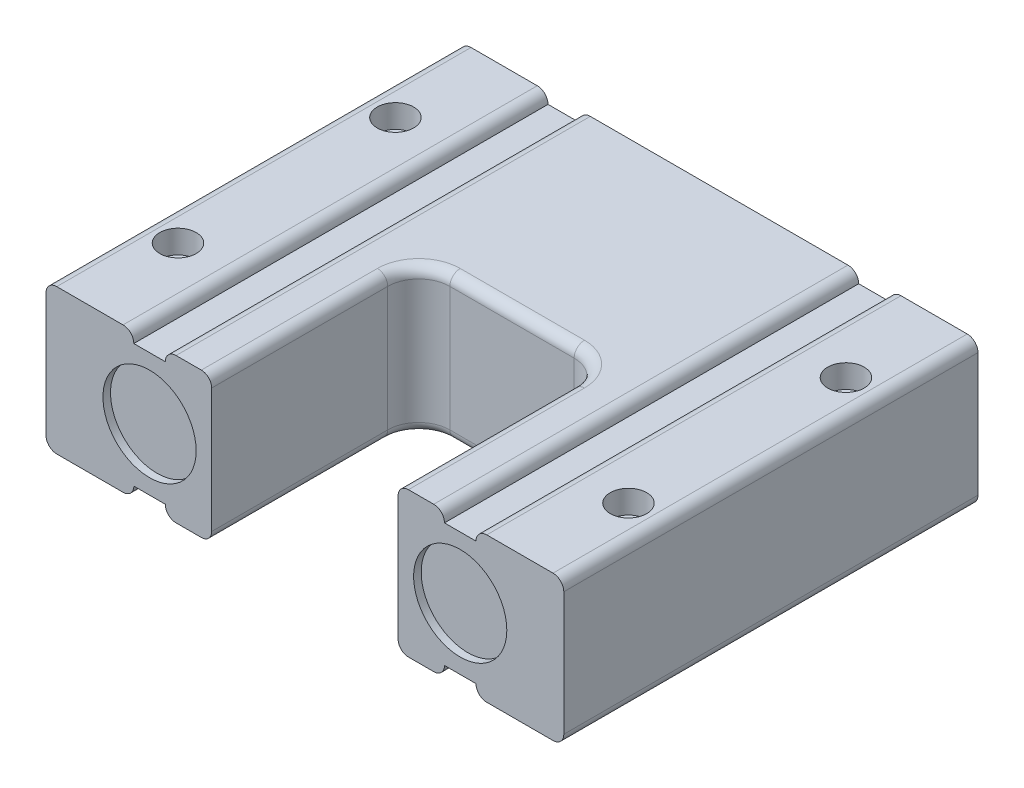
ISO-10303-21;
HEADER;
FILE_DESCRIPTION(('STEP AP214'),'2;1');
FILE_NAME('part.step','',(''),(''),'','','');
FILE_SCHEMA(('AUTOMOTIVE_DESIGN { 1 0 10303 214 1 1 1 1 }'));
ENDSEC;
DATA;
#1=APPLICATION_CONTEXT('core data for automotive mechanical design processes');
#2=APPLICATION_PROTOCOL_DEFINITION('international standard','automotive_design',2000,#1);
#3=PRODUCT_CONTEXT('',#1,'mechanical');
#4=PRODUCT('Part','Part','',(#3));
#5=PRODUCT_RELATED_PRODUCT_CATEGORY('part','',(#4));
#6=PRODUCT_DEFINITION_FORMATION('','',#4);
#7=PRODUCT_DEFINITION_CONTEXT('part definition',#1,'design');
#8=PRODUCT_DEFINITION('design','',#6,#7);
#9=PRODUCT_DEFINITION_SHAPE('','',#8);
#10=(LENGTH_UNIT() NAMED_UNIT(*) SI_UNIT(.MILLI.,.METRE.));
#11=(NAMED_UNIT(*) PLANE_ANGLE_UNIT() SI_UNIT($,.RADIAN.));
#12=(NAMED_UNIT(*) SI_UNIT($,.STERADIAN.) SOLID_ANGLE_UNIT());
#13=UNCERTAINTY_MEASURE_WITH_UNIT(LENGTH_MEASURE(1.E-05),#10,'distance_accuracy_value','');
#14=(GEOMETRIC_REPRESENTATION_CONTEXT(3) GLOBAL_UNCERTAINTY_ASSIGNED_CONTEXT((#13)) GLOBAL_UNIT_ASSIGNED_CONTEXT((#10,
#11,#12)) REPRESENTATION_CONTEXT('',''));
#15=CARTESIAN_POINT('',(0.,0.,0.));
#16=DIRECTION('',(0.,0.,1.));
#17=DIRECTION('',(1.,0.,0.));
#18=AXIS2_PLACEMENT_3D('',#15,#16,#17);
#19=CARTESIAN_POINT('',(61.91123,0.,61.1886));
#20=DIRECTION('',(0.,0.,1.));
#21=DIRECTION('',(1.,0.,0.));
#22=AXIS2_PLACEMENT_3D('',#19,#20,#21);
#23=PLANE('',#22);
#24=CARTESIAN_POINT('',(47.625,0.,61.1886));
#25=DIRECTION('',(0.,0.,1.));
#26=DIRECTION('',(1.,0.,0.));
#27=AXIS2_PLACEMENT_3D('',#24,#25,#26);
#28=CIRCLE('',#27,14.28623);
#29=CARTESIAN_POINT('',(61.91123,0.,61.1886));
#30=VERTEX_POINT('',#29);
#31=EDGE_CURVE('E393',#30,#30,#28,.T.);
#32=ORIENTED_EDGE('',*,*,#31,.T.);
#33=EDGE_LOOP('',(#32));
#34=FACE_BOUND('',#33,.T.);
#35=ADVANCED_FACE('F15',(#34),#23,.T.);
#36=CARTESIAN_POINT('',(79.375,-22.225,63.5));
#37=DIRECTION('',(0.,-1.,0.));
#38=DIRECTION('',(-1.,0.,0.));
#39=AXIS2_PLACEMENT_3D('',#36,#37,#38);
#40=PLANE('',#39);
#41=DIRECTION('',(-1.,0.,0.));
#42=VECTOR('',#41,1.);
#43=CARTESIAN_POINT('',(79.375,-22.225,63.5));
#44=LINE('',#43,#42);
#45=CARTESIAN_POINT('',(39.497,-22.225,63.5));
#46=VERTEX_POINT('',#45);
#47=CARTESIAN_POINT('',(31.75,-22.225,63.5));
#48=VERTEX_POINT('',#47);
#49=EDGE_CURVE('E604',#46,#48,#44,.T.);
#50=ORIENTED_EDGE('',*,*,#49,.T.);
#51=DIRECTION('',(0.,0.,-1.));
#52=VECTOR('',#51,1.);
#53=CARTESIAN_POINT('',(31.75,-22.225,9.525));
#54=LINE('',#53,#52);
#55=CARTESIAN_POINT('',(31.75,-22.225,9.525));
#56=VERTEX_POINT('',#55);
#57=EDGE_CURVE('E9',#48,#56,#54,.T.);
#58=ORIENTED_EDGE('',*,*,#57,.T.);
#59=CARTESIAN_POINT('',(19.05,-22.225,9.525));
#60=DIRECTION('',(0.,-1.,0.));
#61=DIRECTION('',(-1.,0.,0.));
#62=AXIS2_PLACEMENT_3D('',#59,#60,#61);
#63=CIRCLE('',#62,12.7);
#64=CARTESIAN_POINT('',(19.05,-22.225,-3.175));
#65=VERTEX_POINT('',#64);
#66=EDGE_CURVE('E24',#56,#65,#63,.F.);
#67=ORIENTED_EDGE('',*,*,#66,.T.);
#68=DIRECTION('',(-1.,0.,0.));
#69=VECTOR('',#68,1.);
#70=CARTESIAN_POINT('',(-19.05,-22.225,-3.175));
#71=LINE('',#70,#69);
#72=CARTESIAN_POINT('',(-19.05,-22.225,-3.175));
#73=VERTEX_POINT('',#72);
#74=EDGE_CURVE('E770',#65,#73,#71,.T.);
#75=ORIENTED_EDGE('',*,*,#74,.T.);
#76=CARTESIAN_POINT('',(-19.05,-22.225,9.525));
#77=DIRECTION('',(0.,-1.,0.));
#78=DIRECTION('',(-1.,0.,0.));
#79=AXIS2_PLACEMENT_3D('',#76,#77,#78);
#80=CIRCLE('',#79,12.7);
#81=CARTESIAN_POINT('',(-31.75,-22.225,9.525));
#82=VERTEX_POINT('',#81);
#83=EDGE_CURVE('E768',#73,#82,#80,.F.);
#84=ORIENTED_EDGE('',*,*,#83,.T.);
#85=DIRECTION('',(0.,0.,1.));
#86=VECTOR('',#85,1.);
#87=CARTESIAN_POINT('',(-31.75,-22.225,63.5));
#88=LINE('',#87,#86);
#89=CARTESIAN_POINT('',(-31.75,-22.225,63.5));
#90=VERTEX_POINT('',#89);
#91=EDGE_CURVE('E766',#82,#90,#88,.T.);
#92=ORIENTED_EDGE('',*,*,#91,.T.);
#93=CARTESIAN_POINT('',(-39.497,-22.225,63.5));
#94=VERTEX_POINT('',#93);
#95=EDGE_CURVE('E603',#90,#94,#44,.T.);
#96=ORIENTED_EDGE('',*,*,#95,.T.);
#97=DIRECTION('',(0.,0.,-1.));
#98=VECTOR('',#97,1.);
#99=CARTESIAN_POINT('',(-39.497,-22.225,-63.5));
#100=LINE('',#99,#98);
#101=CARTESIAN_POINT('',(-39.497,-22.225,-63.5));
#102=VERTEX_POINT('',#101);
#103=EDGE_CURVE('E711',#94,#102,#100,.T.);
#104=ORIENTED_EDGE('',*,*,#103,.T.);
#105=DIRECTION('',(-1.,0.,0.));
#106=VECTOR('',#105,1.);
#107=CARTESIAN_POINT('',(79.375,-22.225,-63.5));
#108=LINE('',#107,#106);
#109=CARTESIAN_POINT('',(39.497,-22.225,-63.5));
#110=VERTEX_POINT('',#109);
#111=EDGE_CURVE('E621',#110,#102,#108,.T.);
#112=ORIENTED_EDGE('',*,*,#111,.F.);
#113=DIRECTION('',(0.,0.,-1.));
#114=VECTOR('',#113,1.);
#115=CARTESIAN_POINT('',(39.497,-22.225,63.5));
#116=LINE('',#115,#114);
#117=EDGE_CURVE('E709',#110,#46,#116,.F.);
#118=ORIENTED_EDGE('',*,*,#117,.T.);
#119=EDGE_LOOP('',(#50,#58,#67,#75,#84,#92,#96,#104,#112,#118));
#120=FACE_BOUND('',#119,.T.);
#121=DIRECTION('',(-0.99440859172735,0.,0.105600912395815));
#122=VECTOR('',#121,1.);
#123=CARTESIAN_POINT('',(-2.55337422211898,-22.225,-38.1360866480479));
#124=LINE('',#123,#122);
#125=CARTESIAN_POINT('',(-2.55337422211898,-22.225,-38.1360866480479));
#126=VERTEX_POINT('',#125);
#127=CARTESIAN_POINT('',(-2.69352070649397,-22.225,-38.1212038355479));
#128=VERTEX_POINT('',#127);
#129=EDGE_CURVE('E370',#126,#128,#124,.T.);
#130=ORIENTED_EDGE('',*,*,#129,.T.);
#131=DIRECTION('',(0.,0.,1.));
#132=VECTOR('',#131,1.);
#133=CARTESIAN_POINT('',(-2.69352070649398,-22.225,-38.1212038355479));
#134=LINE('',#133,#132);
#135=CARTESIAN_POINT('',(-2.69352070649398,-22.225,-31.6124538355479));
#136=VERTEX_POINT('',#135);
#137=EDGE_CURVE('E32',#128,#136,#134,.T.);
#138=ORIENTED_EDGE('',*,*,#137,.T.);
#139=DIRECTION('',(1.,0.,0.));
#140=VECTOR('',#139,1.);
#141=CARTESIAN_POINT('',(-2.69352070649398,-22.225,-31.6124538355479));
#142=LINE('',#141,#140);
#143=CARTESIAN_POINT('',(-2.53477070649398,-22.225,-31.6124538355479));
#144=VERTEX_POINT('',#143);
#145=EDGE_CURVE('E374',#136,#144,#142,.T.);
#146=ORIENTED_EDGE('',*,*,#145,.T.);
#147=DIRECTION('',(0.,0.,-1.));
#148=VECTOR('',#147,1.);
#149=CARTESIAN_POINT('',(-2.53477070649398,-22.225,-31.6124538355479));
#150=LINE('',#149,#148);
#151=CARTESIAN_POINT('',(-2.53477070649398,-22.225,-37.6275905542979));
#152=VERTEX_POINT('',#151);
#153=EDGE_CURVE('E2086',#144,#152,#150,.T.);
#154=ORIENTED_EDGE('',*,*,#153,.T.);
#155=DIRECTION('',(0.346413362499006,0.,0.938081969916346));
#156=VECTOR('',#155,1.);
#157=CARTESIAN_POINT('',(-2.53477070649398,-22.225,-37.6275905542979));
#158=LINE('',#157,#156);
#159=CARTESIAN_POINT('',(-0.313510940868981,-22.225,-31.6124538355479));
#160=VERTEX_POINT('',#159);
#161=EDGE_CURVE('E2089',#152,#160,#158,.T.);
#162=ORIENTED_EDGE('',*,*,#161,.T.);
#163=DIRECTION('',(1.,0.,0.));
#164=VECTOR('',#163,1.);
#165=CARTESIAN_POINT('',(-0.313510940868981,-22.225,-31.6124538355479));
#166=LINE('',#165,#164);
#167=CARTESIAN_POINT('',(-0.170883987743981,-22.225,-31.6124538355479));
#168=VERTEX_POINT('',#167);
#169=EDGE_CURVE('E2092',#160,#168,#166,.T.);
#170=ORIENTED_EDGE('',*,*,#169,.T.);
#171=DIRECTION('',(0.348962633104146,0.,-0.937136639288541));
#172=VECTOR('',#171,1.);
#173=CARTESIAN_POINT('',(-0.170883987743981,-22.225,-31.6124538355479));
#174=LINE('',#173,#172);
#175=CARTESIAN_POINT('',(2.06897929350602,-22.225,-37.6275905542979));
#176=VERTEX_POINT('',#175);
#177=EDGE_CURVE('E2095',#168,#176,#174,.T.);
#178=ORIENTED_EDGE('',*,*,#177,.T.);
#179=DIRECTION('',(0.,0.,1.));
#180=VECTOR('',#179,1.);
#181=CARTESIAN_POINT('',(2.06897929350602,-22.225,-37.6275905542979));
#182=LINE('',#181,#180);
#183=CARTESIAN_POINT('',(2.06897929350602,-22.225,-31.6124538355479));
#184=VERTEX_POINT('',#183);
#185=EDGE_CURVE('E2098',#176,#184,#182,.T.);
#186=ORIENTED_EDGE('',*,*,#185,.T.);
#187=DIRECTION('',(1.,0.,0.));
#188=VECTOR('',#187,1.);
#189=CARTESIAN_POINT('',(2.06897929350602,-22.225,-31.6124538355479));
#190=LINE('',#189,#188);
#191=CARTESIAN_POINT('',(2.22772929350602,-22.225,-31.6124538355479));
#192=VERTEX_POINT('',#191);
#193=EDGE_CURVE('E2101',#184,#192,#190,.T.);
#194=ORIENTED_EDGE('',*,*,#193,.T.);
#195=DIRECTION('',(0.,0.,-1.));
#196=VECTOR('',#195,1.);
#197=CARTESIAN_POINT('',(2.22772929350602,-22.225,-31.6124538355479));
#198=LINE('',#197,#196);
#199=CARTESIAN_POINT('',(2.22772929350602,-22.225,-38.1212038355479));
#200=VERTEX_POINT('',#199);
#201=EDGE_CURVE('E2104',#192,#200,#198,.T.);
#202=ORIENTED_EDGE('',*,*,#201,.T.);
#203=DIRECTION('',(-0.99689814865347,0.,-0.0787024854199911));
#204=VECTOR('',#203,1.);
#205=CARTESIAN_POINT('',(2.22772929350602,-22.225,-38.1212038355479));
#206=LINE('',#205,#204);
#207=CARTESIAN_POINT('',(2.08634257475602,-22.225,-38.1323659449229));
#208=VERTEX_POINT('',#207);
#209=EDGE_CURVE('E2107',#200,#208,#206,.T.);
#210=ORIENTED_EDGE('',*,*,#209,.T.);
#211=DIRECTION('',(-0.348923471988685,0.,0.937151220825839));
#212=VECTOR('',#211,1.);
#213=CARTESIAN_POINT('',(2.08634257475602,-22.225,-38.1323659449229));
#214=LINE('',#213,#212);
#215=CARTESIAN_POINT('',(-0.242817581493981,-22.225,-31.8766237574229));
#216=VERTEX_POINT('',#215);
#217=EDGE_CURVE('E2110',#208,#216,#214,.T.);
#218=ORIENTED_EDGE('',*,*,#217,.T.);
#219=DIRECTION('',(-0.346291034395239,0.,-0.938127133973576));
#220=VECTOR('',#219,1.);
#221=CARTESIAN_POINT('',(-0.242817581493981,-22.225,-31.8766237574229));
#222=LINE('',#221,#220);
#223=EDGE_CURVE('E2113',#216,#126,#222,.T.);
#224=ORIENTED_EDGE('',*,*,#223,.T.);
#225=EDGE_LOOP('',(#130,#138,#146,#154,#162,#170,#178,#186,#194,#202,#210,#218,#224));
#226=FACE_BOUND('',#225,.T.);
#227=ADVANCED_FACE('F803',(#120,#226),#40,.T.);
#228=CARTESIAN_POINT('',(-47.625,0.,48.9244952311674));
#229=DIRECTION('',(0.,0.,1.));
#230=DIRECTION('',(1.,0.,0.));
#231=AXIS2_PLACEMENT_3D('',#228,#229,#230);
#232=CYLINDRICAL_SURFACE('',#231,14.28623);
#233=CARTESIAN_POINT('',(-47.625,0.,-61.1886));
#234=DIRECTION('',(0.,0.,1.));
#235=DIRECTION('',(1.,0.,0.));
#236=AXIS2_PLACEMENT_3D('',#233,#234,#235);
#237=CIRCLE('',#236,14.28623);
#238=CARTESIAN_POINT('',(-33.33877,0.,-61.1886));
#239=VERTEX_POINT('',#238);
#240=EDGE_CURVE('E2058',#239,#239,#237,.F.);
#241=ORIENTED_EDGE('',*,*,#240,.F.);
#242=EDGE_LOOP('',(#241));
#243=FACE_BOUND('',#242,.T.);
#244=CARTESIAN_POINT('',(-47.625,0.,-63.5));
#245=DIRECTION('',(0.,0.,1.));
#246=DIRECTION('',(1.,0.,0.));
#247=AXIS2_PLACEMENT_3D('',#244,#245,#246);
#248=CIRCLE('',#247,14.28623);
#249=CARTESIAN_POINT('',(-33.33877,0.,-63.5));
#250=VERTEX_POINT('',#249);
#251=EDGE_CURVE('E390',#250,#250,#248,.T.);
#252=ORIENTED_EDGE('',*,*,#251,.F.);
#253=EDGE_LOOP('',(#252));
#254=FACE_BOUND('',#253,.T.);
#255=ADVANCED_FACE('F933',(#243,#254),#232,.F.);
#256=CARTESIAN_POINT('',(47.625,0.,48.9244952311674));
#257=DIRECTION('',(0.,0.,1.));
#258=DIRECTION('',(1.,0.,0.));
#259=AXIS2_PLACEMENT_3D('',#256,#257,#258);
#260=CYLINDRICAL_SURFACE('',#259,14.28623);
#261=CARTESIAN_POINT('',(47.625,0.,-61.1886));
#262=DIRECTION('',(0.,0.,1.));
#263=DIRECTION('',(1.,0.,0.));
#264=AXIS2_PLACEMENT_3D('',#261,#262,#263);
#265=CIRCLE('',#264,14.28623);
#266=CARTESIAN_POINT('',(61.91123,0.,-61.1886));
#267=VERTEX_POINT('',#266);
#268=EDGE_CURVE('E2057',#267,#267,#265,.F.);
#269=ORIENTED_EDGE('',*,*,#268,.F.);
#270=EDGE_LOOP('',(#269));
#271=FACE_BOUND('',#270,.T.);
#272=CARTESIAN_POINT('',(47.625,0.,-63.5));
#273=DIRECTION('',(0.,0.,1.));
#274=DIRECTION('',(1.,0.,0.));
#275=AXIS2_PLACEMENT_3D('',#272,#273,#274);
#276=CIRCLE('',#275,14.28623);
#277=CARTESIAN_POINT('',(61.91123,0.,-63.5));
#278=VERTEX_POINT('',#277);
#279=EDGE_CURVE('E399',#278,#278,#276,.T.);
#280=ORIENTED_EDGE('',*,*,#279,.F.);
#281=EDGE_LOOP('',(#280));
#282=FACE_BOUND('',#281,.T.);
#283=ADVANCED_FACE('F1002',(#271,#282),#260,.F.);
#284=CARTESIAN_POINT('',(65.7225,15.113,-33.3248));
#285=DIRECTION('',(0.,-1.,0.));
#286=DIRECTION('',(0.,0.,1.));
#287=AXIS2_PLACEMENT_3D('',#284,#285,#286);
#288=PLANE('',#287);
#289=CARTESIAN_POINT('',(69.0626,15.113,-33.3248));
#290=DIRECTION('',(0.,1.,0.));
#291=DIRECTION('',(0.,0.,-1.));
#292=AXIS2_PLACEMENT_3D('',#289,#290,#291);
#293=CIRCLE('',#292,5.588);
#294=CARTESIAN_POINT('',(69.0626,15.113,-38.9128));
#295=VERTEX_POINT('',#294);
#296=EDGE_CURVE('E496',#295,#295,#293,.T.);
#297=ORIENTED_EDGE('',*,*,#296,.T.);
#298=EDGE_LOOP('',(#297));
#299=FACE_BOUND('',#298,.T.);
#300=CARTESIAN_POINT('',(69.0626,15.113,-33.3248));
#301=DIRECTION('',(0.,1.,0.));
#302=DIRECTION('',(0.,0.,-1.));
#303=AXIS2_PLACEMENT_3D('',#300,#301,#302);
#304=CIRCLE('',#303,3.4);
#305=CARTESIAN_POINT('',(69.0626,15.113,-36.7248));
#306=VERTEX_POINT('',#305);
#307=EDGE_CURVE('E468',#306,#306,#304,.T.);
#308=ORIENTED_EDGE('',*,*,#307,.F.);
#309=EDGE_LOOP('',(#308));
#310=FACE_BOUND('',#309,.T.);
#311=ADVANCED_FACE('F1010',(#299,#310),#288,.F.);
#312=CARTESIAN_POINT('',(65.7225,15.113,33.3502));
#313=DIRECTION('',(0.,-1.,0.));
#314=DIRECTION('',(0.,0.,1.));
#315=AXIS2_PLACEMENT_3D('',#312,#313,#314);
#316=PLANE('',#315);
#317=CARTESIAN_POINT('',(69.0626,15.113,33.3502));
#318=DIRECTION('',(0.,1.,0.));
#319=DIRECTION('',(0.,0.,-1.));
#320=AXIS2_PLACEMENT_3D('',#317,#318,#319);
#321=CIRCLE('',#320,5.588);
#322=CARTESIAN_POINT('',(69.0626,15.113,27.7622));
#323=VERTEX_POINT('',#322);
#324=EDGE_CURVE('E505',#323,#323,#321,.T.);
#325=ORIENTED_EDGE('',*,*,#324,.T.);
#326=EDGE_LOOP('',(#325));
#327=FACE_BOUND('',#326,.T.);
#328=CARTESIAN_POINT('',(69.0626,15.113,33.3502));
#329=DIRECTION('',(0.,1.,0.));
#330=DIRECTION('',(0.,0.,-1.));
#331=AXIS2_PLACEMENT_3D('',#328,#329,#330);
#332=CIRCLE('',#331,3.4);
#333=CARTESIAN_POINT('',(69.0626,15.113,29.9502));
#334=VERTEX_POINT('',#333);
#335=EDGE_CURVE('E475',#334,#334,#332,.T.);
#336=ORIENTED_EDGE('',*,*,#335,.F.);
#337=EDGE_LOOP('',(#336));
#338=FACE_BOUND('',#337,.T.);
#339=ADVANCED_FACE('F1135',(#327,#338),#316,.F.);
#340=CARTESIAN_POINT('',(-72.4027,15.113,-33.3248));
#341=DIRECTION('',(0.,-1.,0.));
#342=DIRECTION('',(0.,0.,1.));
#343=AXIS2_PLACEMENT_3D('',#340,#341,#342);
#344=PLANE('',#343);
#345=CARTESIAN_POINT('',(-69.0626,15.113,-33.3248));
#346=DIRECTION('',(0.,1.,0.));
#347=DIRECTION('',(0.,0.,-1.));
#348=AXIS2_PLACEMENT_3D('',#345,#346,#347);
#349=CIRCLE('',#348,5.588);
#350=CARTESIAN_POINT('',(-69.0626,15.113,-38.9128));
#351=VERTEX_POINT('',#350);
#352=EDGE_CURVE('E523',#351,#351,#349,.T.);
#353=ORIENTED_EDGE('',*,*,#352,.T.);
#354=EDGE_LOOP('',(#353));
#355=FACE_BOUND('',#354,.T.);
#356=CARTESIAN_POINT('',(-69.0626,15.113,-33.3248));
#357=DIRECTION('',(0.,1.,0.));
#358=DIRECTION('',(0.,0.,-1.));
#359=AXIS2_PLACEMENT_3D('',#356,#357,#358);
#360=CIRCLE('',#359,3.4);
#361=CARTESIAN_POINT('',(-69.0626,15.113,-36.7248));
#362=VERTEX_POINT('',#361);
#363=EDGE_CURVE('E489',#362,#362,#360,.T.);
#364=ORIENTED_EDGE('',*,*,#363,.F.);
#365=EDGE_LOOP('',(#364));
#366=FACE_BOUND('',#365,.T.);
#367=ADVANCED_FACE('F1147',(#355,#366),#344,.F.);
#368=CARTESIAN_POINT('',(79.375,22.225,63.5));
#369=DIRECTION('',(0.,1.,0.));
#370=DIRECTION('',(1.,0.,0.));
#371=AXIS2_PLACEMENT_3D('',#368,#369,#370);
#372=PLANE('',#371);
#373=CARTESIAN_POINT('',(19.05,22.225,9.525));
#374=DIRECTION('',(0.,1.,0.));
#375=DIRECTION('',(1.,0.,0.));
#376=AXIS2_PLACEMENT_3D('',#373,#374,#375);
#377=CIRCLE('',#376,12.7);
#378=CARTESIAN_POINT('',(19.05,22.225,-3.175));
#379=VERTEX_POINT('',#378);
#380=CARTESIAN_POINT('',(31.75,22.225,9.525));
#381=VERTEX_POINT('',#380);
#382=EDGE_CURVE('E738',#379,#381,#377,.F.);
#383=ORIENTED_EDGE('',*,*,#382,.T.);
#384=DIRECTION('',(0.,0.,-1.));
#385=VECTOR('',#384,1.);
#386=CARTESIAN_POINT('',(31.75,22.225,63.5));
#387=LINE('',#386,#385);
#388=CARTESIAN_POINT('',(31.75,22.225,63.5));
#389=VERTEX_POINT('',#388);
#390=EDGE_CURVE('E740',#381,#389,#387,.F.);
#391=ORIENTED_EDGE('',*,*,#390,.T.);
#392=DIRECTION('',(1.,0.,0.));
#393=VECTOR('',#392,1.);
#394=CARTESIAN_POINT('',(79.375,22.225,63.5));
#395=LINE('',#394,#393);
#396=CARTESIAN_POINT('',(39.497,22.225,63.5));
#397=VERTEX_POINT('',#396);
#398=EDGE_CURVE('E615',#389,#397,#395,.T.);
#399=ORIENTED_EDGE('',*,*,#398,.T.);
#400=DIRECTION('',(0.,0.,-1.));
#401=VECTOR('',#400,1.);
#402=CARTESIAN_POINT('',(39.497,22.225,-63.5));
#403=LINE('',#402,#401);
#404=CARTESIAN_POINT('',(39.497,22.225,-63.5));
#405=VERTEX_POINT('',#404);
#406=EDGE_CURVE('E678',#397,#405,#403,.T.);
#407=ORIENTED_EDGE('',*,*,#406,.T.);
#408=DIRECTION('',(1.,0.,0.));
#409=VECTOR('',#408,1.);
#410=CARTESIAN_POINT('',(79.375,22.225,-63.5));
#411=LINE('',#410,#409);
#412=CARTESIAN_POINT('',(-39.497,22.225,-63.5));
#413=VERTEX_POINT('',#412);
#414=EDGE_CURVE('E627',#413,#405,#411,.T.);
#415=ORIENTED_EDGE('',*,*,#414,.F.);
#416=DIRECTION('',(0.,0.,-1.));
#417=VECTOR('',#416,1.);
#418=CARTESIAN_POINT('',(-39.497,22.225,63.5));
#419=LINE('',#418,#417);
#420=CARTESIAN_POINT('',(-39.497,22.225,63.5));
#421=VERTEX_POINT('',#420);
#422=EDGE_CURVE('E676',#413,#421,#419,.F.);
#423=ORIENTED_EDGE('',*,*,#422,.T.);
#424=CARTESIAN_POINT('',(-31.75,22.225,63.5));
#425=VERTEX_POINT('',#424);
#426=EDGE_CURVE('E614',#421,#425,#395,.T.);
#427=ORIENTED_EDGE('',*,*,#426,.T.);
#428=DIRECTION('',(0.,0.,1.));
#429=VECTOR('',#428,1.);
#430=CARTESIAN_POINT('',(-31.75,22.225,9.525));
#431=LINE('',#430,#429);
#432=CARTESIAN_POINT('',(-31.75,22.225,9.525));
#433=VERTEX_POINT('',#432);
#434=EDGE_CURVE('E732',#425,#433,#431,.F.);
#435=ORIENTED_EDGE('',*,*,#434,.T.);
#436=CARTESIAN_POINT('',(-19.05,22.225,9.525));
#437=DIRECTION('',(0.,1.,0.));
#438=DIRECTION('',(1.,0.,0.));
#439=AXIS2_PLACEMENT_3D('',#436,#437,#438);
#440=CIRCLE('',#439,12.7);
#441=CARTESIAN_POINT('',(-19.05,22.225,-3.175));
#442=VERTEX_POINT('',#441);
#443=EDGE_CURVE('E734',#433,#442,#440,.F.);
#444=ORIENTED_EDGE('',*,*,#443,.T.);
#445=DIRECTION('',(-1.,0.,0.));
#446=VECTOR('',#445,1.);
#447=CARTESIAN_POINT('',(19.05,22.225,-3.175));
#448=LINE('',#447,#446);
#449=EDGE_CURVE('E736',#442,#379,#448,.F.);
#450=ORIENTED_EDGE('',*,*,#449,.T.);
#451=EDGE_LOOP('',(#383,#391,#399,#407,#415,#423,#427,#435,#444,#450));
#452=FACE_BOUND('',#451,.T.);
#453=ADVANCED_FACE('F1171',(#452),#372,.T.);
#454=CARTESIAN_POINT('',(69.0626,-22.225,0.));
#455=DIRECTION('',(0.,-1.,0.));
#456=DIRECTION('',(0.,0.,1.));
#457=AXIS2_PLACEMENT_3D('',#454,#455,#456);
#458=CIRCLE('',#457,5.0038);
#459=CARTESIAN_POINT('',(69.0626,-22.225,5.00380000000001));
#460=VERTEX_POINT('',#459);
#461=EDGE_CURVE('E462',#460,#460,#458,.T.);
#462=ORIENTED_EDGE('',*,*,#461,.F.);
#463=EDGE_LOOP('',(#462));
#464=FACE_BOUND('',#463,.T.);
#465=CARTESIAN_POINT('',(69.0626,-22.225,-33.3248));
#466=DIRECTION('',(0.,1.,0.));
#467=DIRECTION('',(0.,0.,-1.));
#468=AXIS2_PLACEMENT_3D('',#465,#466,#467);
#469=CIRCLE('',#468,3.3401);
#470=CARTESIAN_POINT('',(69.0626,-22.225,-36.6649));
#471=VERTEX_POINT('',#470);
#472=EDGE_CURVE('E493',#471,#471,#469,.T.);
#473=ORIENTED_EDGE('',*,*,#472,.T.);
#474=EDGE_LOOP('',(#473));
#475=FACE_BOUND('',#474,.T.);
#476=CARTESIAN_POINT('',(69.0626,-22.225,33.3502));
#477=DIRECTION('',(0.,1.,0.));
#478=DIRECTION('',(0.,0.,-1.));
#479=AXIS2_PLACEMENT_3D('',#476,#477,#478);
#480=CIRCLE('',#479,3.3401);
#481=CARTESIAN_POINT('',(69.0626,-22.225,30.0101));
#482=VERTEX_POINT('',#481);
#483=EDGE_CURVE('E502',#482,#482,#480,.T.);
#484=ORIENTED_EDGE('',*,*,#483,.T.);
#485=EDGE_LOOP('',(#484));
#486=FACE_BOUND('',#485,.T.);
#487=CARTESIAN_POINT('',(76.073,-22.225,63.5));
#488=VERTEX_POINT('',#487);
#489=CARTESIAN_POINT('',(55.753,-22.225,63.5));
#490=VERTEX_POINT('',#489);
#491=EDGE_CURVE('E609',#488,#490,#44,.T.);
#492=ORIENTED_EDGE('',*,*,#491,.T.);
#493=DIRECTION('',(0.,0.,-1.));
#494=VECTOR('',#493,1.);
#495=CARTESIAN_POINT('',(55.753,-22.225,-63.5));
#496=LINE('',#495,#494);
#497=CARTESIAN_POINT('',(55.753,-22.225,-63.5));
#498=VERTEX_POINT('',#497);
#499=EDGE_CURVE('E716',#490,#498,#496,.T.);
#500=ORIENTED_EDGE('',*,*,#499,.T.);
#501=CARTESIAN_POINT('',(76.073,-22.225,-63.5));
#502=VERTEX_POINT('',#501);
#503=EDGE_CURVE('E622',#502,#498,#108,.T.);
#504=ORIENTED_EDGE('',*,*,#503,.F.);
#505=DIRECTION('',(0.,0.,-1.));
#506=VECTOR('',#505,1.);
#507=CARTESIAN_POINT('',(76.073,-22.225,63.5));
#508=LINE('',#507,#506);
#509=EDGE_CURVE('E714',#502,#488,#508,.F.);
#510=ORIENTED_EDGE('',*,*,#509,.T.);
#511=EDGE_LOOP('',(#492,#500,#504,#510));
#512=FACE_BOUND('',#511,.T.);
#513=ADVANCED_FACE('F814',(#464,#475,#486,#512),#40,.T.);
#514=CARTESIAN_POINT('',(-69.0626,-22.225,0.));
#515=DIRECTION('',(0.,-1.,0.));
#516=DIRECTION('',(0.,0.,1.));
#517=AXIS2_PLACEMENT_3D('',#514,#515,#516);
#518=CIRCLE('',#517,5.0038);
#519=CARTESIAN_POINT('',(-69.0626,-22.225,5.00380000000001));
#520=VERTEX_POINT('',#519);
#521=EDGE_CURVE('E456',#520,#520,#518,.T.);
#522=ORIENTED_EDGE('',*,*,#521,.F.);
#523=EDGE_LOOP('',(#522));
#524=FACE_BOUND('',#523,.T.);
#525=CARTESIAN_POINT('',(-69.0626,-22.225,33.3502));
#526=DIRECTION('',(0.,1.,0.));
#527=DIRECTION('',(0.,0.,-1.));
#528=AXIS2_PLACEMENT_3D('',#525,#526,#527);
#529=CIRCLE('',#528,3.3401);
#530=CARTESIAN_POINT('',(-69.0626,-22.225,30.0101));
#531=VERTEX_POINT('',#530);
#532=EDGE_CURVE('E511',#531,#531,#529,.T.);
#533=ORIENTED_EDGE('',*,*,#532,.T.);
#534=EDGE_LOOP('',(#533));
#535=FACE_BOUND('',#534,.T.);
#536=CARTESIAN_POINT('',(-69.0626,-22.225,-33.3248));
#537=DIRECTION('',(0.,1.,0.));
#538=DIRECTION('',(0.,0.,-1.));
#539=AXIS2_PLACEMENT_3D('',#536,#537,#538);
#540=CIRCLE('',#539,3.3401);
#541=CARTESIAN_POINT('',(-69.0626,-22.225,-36.6649));
#542=VERTEX_POINT('',#541);
#543=EDGE_CURVE('E520',#542,#542,#540,.T.);
#544=ORIENTED_EDGE('',*,*,#543,.T.);
#545=EDGE_LOOP('',(#544));
#546=FACE_BOUND('',#545,.T.);
#547=CARTESIAN_POINT('',(-55.753,-22.225,63.5));
#548=VERTEX_POINT('',#547);
#549=CARTESIAN_POINT('',(-76.073,-22.225,63.5));
#550=VERTEX_POINT('',#549);
#551=EDGE_CURVE('E599',#548,#550,#44,.T.);
#552=ORIENTED_EDGE('',*,*,#551,.T.);
#553=DIRECTION('',(0.,0.,-1.));
#554=VECTOR('',#553,1.);
#555=CARTESIAN_POINT('',(-76.073,-22.225,63.5));
#556=LINE('',#555,#554);
#557=CARTESIAN_POINT('',(-76.073,-22.225,-63.5));
#558=VERTEX_POINT('',#557);
#559=EDGE_CURVE('E706',#550,#558,#556,.T.);
#560=ORIENTED_EDGE('',*,*,#559,.T.);
#561=CARTESIAN_POINT('',(-55.753,-22.225,-63.5));
#562=VERTEX_POINT('',#561);
#563=EDGE_CURVE('E618',#562,#558,#108,.T.);
#564=ORIENTED_EDGE('',*,*,#563,.F.);
#565=DIRECTION('',(0.,0.,-1.));
#566=VECTOR('',#565,1.);
#567=CARTESIAN_POINT('',(-55.753,-22.225,63.5));
#568=LINE('',#567,#566);
#569=EDGE_CURVE('E704',#562,#548,#568,.F.);
#570=ORIENTED_EDGE('',*,*,#569,.T.);
#571=EDGE_LOOP('',(#552,#560,#564,#570));
#572=FACE_BOUND('',#571,.T.);
#573=ADVANCED_FACE('F851',(#524,#535,#546,#572),#40,.T.);
#574=CARTESIAN_POINT('',(69.0626,22.225,-33.3248));
#575=DIRECTION('',(0.,1.,0.));
#576=DIRECTION('',(0.,0.,-1.));
#577=AXIS2_PLACEMENT_3D('',#574,#575,#576);
#578=CIRCLE('',#577,5.588);
#579=CARTESIAN_POINT('',(69.0626,22.225,-38.9128));
#580=VERTEX_POINT('',#579);
#581=EDGE_CURVE('E499',#580,#580,#578,.T.);
#582=ORIENTED_EDGE('',*,*,#581,.F.);
#583=EDGE_LOOP('',(#582));
#584=FACE_BOUND('',#583,.T.);
#585=CARTESIAN_POINT('',(69.0626,22.225,33.3502));
#586=DIRECTION('',(0.,1.,0.));
#587=DIRECTION('',(0.,0.,-1.));
#588=AXIS2_PLACEMENT_3D('',#585,#586,#587);
#589=CIRCLE('',#588,5.588);
#590=CARTESIAN_POINT('',(69.0626,22.225,27.7622));
#591=VERTEX_POINT('',#590);
#592=EDGE_CURVE('E508',#591,#591,#589,.T.);
#593=ORIENTED_EDGE('',*,*,#592,.F.);
#594=EDGE_LOOP('',(#593));
#595=FACE_BOUND('',#594,.T.);
#596=CARTESIAN_POINT('',(55.753,22.225,63.5));
#597=VERTEX_POINT('',#596);
#598=CARTESIAN_POINT('',(76.073,22.225,63.5));
#599=VERTEX_POINT('',#598);
#600=EDGE_CURVE('E608',#597,#599,#395,.T.);
#601=ORIENTED_EDGE('',*,*,#600,.T.);
#602=DIRECTION('',(0.,0.,-1.));
#603=VECTOR('',#602,1.);
#604=CARTESIAN_POINT('',(76.073,22.225,63.5));
#605=LINE('',#604,#603);
#606=CARTESIAN_POINT('',(76.073,22.225,-63.5));
#607=VERTEX_POINT('',#606);
#608=EDGE_CURVE('E631',#599,#607,#605,.T.);
#609=ORIENTED_EDGE('',*,*,#608,.T.);
#610=CARTESIAN_POINT('',(55.753,22.225,-63.5));
#611=VERTEX_POINT('',#610);
#612=EDGE_CURVE('E626',#611,#607,#411,.T.);
#613=ORIENTED_EDGE('',*,*,#612,.F.);
#614=DIRECTION('',(0.,0.,-1.));
#615=VECTOR('',#614,1.);
#616=CARTESIAN_POINT('',(55.753,22.225,63.5));
#617=LINE('',#616,#615);
#618=EDGE_CURVE('E613',#611,#597,#617,.F.);
#619=ORIENTED_EDGE('',*,*,#618,.T.);
#620=EDGE_LOOP('',(#601,#609,#613,#619));
#621=FACE_BOUND('',#620,.T.);
#622=ADVANCED_FACE('F879',(#584,#595,#621),#372,.T.);
#623=CARTESIAN_POINT('',(79.375,-22.225,63.5));
#624=DIRECTION('',(0.,0.,-1.));
#625=DIRECTION('',(-1.,0.,0.));
#626=AXIS2_PLACEMENT_3D('',#623,#624,#625);
#627=PLANE('',#626);
#628=CARTESIAN_POINT('',(-47.625,0.,63.5));
#629=DIRECTION('',(0.,0.,1.));
#630=DIRECTION('',(1.,0.,0.));
#631=AXIS2_PLACEMENT_3D('',#628,#629,#630);
#632=CIRCLE('',#631,14.28623);
#633=CARTESIAN_POINT('',(-33.33877,0.,63.5));
#634=VERTEX_POINT('',#633);
#635=EDGE_CURVE('E386',#634,#634,#632,.T.);
#636=ORIENTED_EDGE('',*,*,#635,.F.);
#637=EDGE_LOOP('',(#636));
#638=FACE_BOUND('',#637,.T.);
#639=DIRECTION('',(0.,1.,0.));
#640=VECTOR('',#639,1.);
#641=CARTESIAN_POINT('',(-28.575,-22.225,63.5));
#642=LINE('',#641,#640);
#643=CARTESIAN_POINT('',(-28.575,-19.05,63.5));
#644=VERTEX_POINT('',#643);
#645=CARTESIAN_POINT('',(-28.575,19.05,63.5));
#646=VERTEX_POINT('',#645);
#647=EDGE_CURVE('E575',#644,#646,#642,.T.);
#648=ORIENTED_EDGE('',*,*,#647,.T.);
#649=CARTESIAN_POINT('',(-31.75,19.05,63.5));
#650=DIRECTION('',(0.,0.,-1.));
#651=DIRECTION('',(-1.,0.,0.));
#652=AXIS2_PLACEMENT_3D('',#649,#650,#651);
#653=CIRCLE('',#652,3.175);
#654=EDGE_CURVE('E764',#646,#425,#653,.F.);
#655=ORIENTED_EDGE('',*,*,#654,.T.);
#656=ORIENTED_EDGE('',*,*,#426,.F.);
#657=CARTESIAN_POINT('',(-39.497,18.923,63.5));
#658=DIRECTION('',(0.,0.,-1.));
#659=DIRECTION('',(-1.,0.,0.));
#660=AXIS2_PLACEMENT_3D('',#657,#658,#659);
#661=CIRCLE('',#660,3.302);
#662=CARTESIAN_POINT('',(-42.799,18.923,63.5));
#663=VERTEX_POINT('',#662);
#664=EDGE_CURVE('E692',#421,#663,#661,.F.);
#665=ORIENTED_EDGE('',*,*,#664,.T.);
#666=DIRECTION('',(-1.,0.,0.));
#667=VECTOR('',#666,1.);
#668=CARTESIAN_POINT('',(-42.799,18.923,63.5));
#669=LINE('',#668,#667);
#670=CARTESIAN_POINT('',(-52.451,18.923,63.5));
#671=VERTEX_POINT('',#670);
#672=EDGE_CURVE('E566',#663,#671,#669,.T.);
#673=ORIENTED_EDGE('',*,*,#672,.T.);
#674=CARTESIAN_POINT('',(-55.753,18.923,63.5));
#675=DIRECTION('',(0.,0.,-1.));
#676=DIRECTION('',(-1.,0.,0.));
#677=AXIS2_PLACEMENT_3D('',#674,#675,#676);
#678=CIRCLE('',#677,3.302);
#679=CARTESIAN_POINT('',(-55.753,22.225,63.5));
#680=VERTEX_POINT('',#679);
#681=EDGE_CURVE('E690',#671,#680,#678,.F.);
#682=ORIENTED_EDGE('',*,*,#681,.T.);
#683=CARTESIAN_POINT('',(-76.073,22.225,63.5));
#684=VERTEX_POINT('',#683);
#685=EDGE_CURVE('E610',#684,#680,#395,.T.);
#686=ORIENTED_EDGE('',*,*,#685,.F.);
#687=CARTESIAN_POINT('',(-76.073,18.923,63.5));
#688=DIRECTION('',(0.,0.,-1.));
#689=DIRECTION('',(-1.,0.,0.));
#690=AXIS2_PLACEMENT_3D('',#687,#688,#689);
#691=CIRCLE('',#690,3.302);
#692=CARTESIAN_POINT('',(-79.375,18.923,63.5));
#693=VERTEX_POINT('',#692);
#694=EDGE_CURVE('E688',#684,#693,#691,.F.);
#695=ORIENTED_EDGE('',*,*,#694,.T.);
#696=DIRECTION('',(0.,1.,0.));
#697=VECTOR('',#696,1.);
#698=CARTESIAN_POINT('',(-79.375,22.225,63.5));
#699=LINE('',#698,#697);
#700=CARTESIAN_POINT('',(-79.375,-18.923,63.5));
#701=VERTEX_POINT('',#700);
#702=EDGE_CURVE('E605',#701,#693,#699,.T.);
#703=ORIENTED_EDGE('',*,*,#702,.F.);
#704=CARTESIAN_POINT('',(-76.073,-18.923,63.5));
#705=DIRECTION('',(0.,0.,-1.));
#706=DIRECTION('',(-1.,0.,0.));
#707=AXIS2_PLACEMENT_3D('',#704,#705,#706);
#708=CIRCLE('',#707,3.302);
#709=EDGE_CURVE('E686',#701,#550,#708,.F.);
#710=ORIENTED_EDGE('',*,*,#709,.T.);
#711=ORIENTED_EDGE('',*,*,#551,.F.);
#712=CARTESIAN_POINT('',(-55.753,-18.923,63.5));
#713=DIRECTION('',(0.,0.,-1.));
#714=DIRECTION('',(-1.,0.,0.));
#715=AXIS2_PLACEMENT_3D('',#712,#713,#714);
#716=CIRCLE('',#715,3.302);
#717=CARTESIAN_POINT('',(-52.451,-18.923,63.5));
#718=VERTEX_POINT('',#717);
#719=EDGE_CURVE('E684',#548,#718,#716,.F.);
#720=ORIENTED_EDGE('',*,*,#719,.T.);
#721=DIRECTION('',(1.,0.,0.));
#722=VECTOR('',#721,1.);
#723=CARTESIAN_POINT('',(-52.451,-18.923,63.5));
#724=LINE('',#723,#722);
#725=CARTESIAN_POINT('',(-42.799,-18.923,63.5));
#726=VERTEX_POINT('',#725);
#727=EDGE_CURVE('E554',#718,#726,#724,.T.);
#728=ORIENTED_EDGE('',*,*,#727,.T.);
#729=CARTESIAN_POINT('',(-39.497,-18.923,63.5));
#730=DIRECTION('',(0.,0.,-1.));
#731=DIRECTION('',(-1.,0.,0.));
#732=AXIS2_PLACEMENT_3D('',#729,#730,#731);
#733=CIRCLE('',#732,3.302);
#734=EDGE_CURVE('E681',#726,#94,#733,.F.);
#735=ORIENTED_EDGE('',*,*,#734,.T.);
#736=ORIENTED_EDGE('',*,*,#95,.F.);
#737=CARTESIAN_POINT('',(-31.75,-19.05,63.5));
#738=DIRECTION('',(0.,0.,-1.));
#739=DIRECTION('',(-1.,0.,0.));
#740=AXIS2_PLACEMENT_3D('',#737,#738,#739);
#741=CIRCLE('',#740,3.175);
#742=EDGE_CURVE('E762',#90,#644,#741,.F.);
#743=ORIENTED_EDGE('',*,*,#742,.T.);
#744=EDGE_LOOP('',(#648,#655,#656,#665,#673,#682,#686,#695,#703,#710,#711,#720,#728,#735,#736,#743));
#745=FACE_BOUND('',#744,.T.);
#746=ADVANCED_FACE('F806',(#638,#745),#627,.F.);
#747=CARTESIAN_POINT('',(79.375,22.225,63.5));
#748=DIRECTION('',(1.,0.,0.));
#749=DIRECTION('',(0.,0.,-1.));
#750=AXIS2_PLACEMENT_3D('',#747,#748,#749);
#751=PLANE('',#750);
#752=DIRECTION('',(0.,-1.,0.));
#753=VECTOR('',#752,1.);
#754=CARTESIAN_POINT('',(79.375,22.225,-63.5));
#755=LINE('',#754,#753);
#756=CARTESIAN_POINT('',(79.375,18.923,-63.5));
#757=VERTEX_POINT('',#756);
#758=CARTESIAN_POINT('',(79.375,-18.923,-63.5));
#759=VERTEX_POINT('',#758);
#760=EDGE_CURVE('E581',#757,#759,#755,.T.);
#761=ORIENTED_EDGE('',*,*,#760,.F.);
#762=DIRECTION('',(0.,0.,-1.));
#763=VECTOR('',#762,1.);
#764=CARTESIAN_POINT('',(79.375,18.923,63.5));
#765=LINE('',#764,#763);
#766=CARTESIAN_POINT('',(79.375,18.923,63.5));
#767=VERTEX_POINT('',#766);
#768=EDGE_CURVE('E661',#757,#767,#765,.F.);
#769=ORIENTED_EDGE('',*,*,#768,.T.);
#770=DIRECTION('',(0.,-1.,0.));
#771=VECTOR('',#770,1.);
#772=CARTESIAN_POINT('',(79.375,22.225,63.5));
#773=LINE('',#772,#771);
#774=CARTESIAN_POINT('',(79.375,-18.923,63.5));
#775=VERTEX_POINT('',#774);
#776=EDGE_CURVE('E596',#767,#775,#773,.T.);
#777=ORIENTED_EDGE('',*,*,#776,.T.);
#778=DIRECTION('',(0.,0.,-1.));
#779=VECTOR('',#778,1.);
#780=CARTESIAN_POINT('',(79.375,-18.923,63.5));
#781=LINE('',#780,#779);
#782=EDGE_CURVE('E658',#775,#759,#781,.T.);
#783=ORIENTED_EDGE('',*,*,#782,.T.);
#784=EDGE_LOOP('',(#761,#769,#777,#783));
#785=FACE_BOUND('',#784,.T.);
#786=ADVANCED_FACE('F1212',(#785),#751,.T.);
#787=CARTESIAN_POINT('',(-69.0626,22.225,33.3502));
#788=DIRECTION('',(0.,1.,0.));
#789=DIRECTION('',(0.,0.,-1.));
#790=AXIS2_PLACEMENT_3D('',#787,#788,#789);
#791=CIRCLE('',#790,5.588);
#792=CARTESIAN_POINT('',(-69.0626,22.225,27.7622));
#793=VERTEX_POINT('',#792);
#794=EDGE_CURVE('E517',#793,#793,#791,.T.);
#795=ORIENTED_EDGE('',*,*,#794,.F.);
#796=EDGE_LOOP('',(#795));
#797=FACE_BOUND('',#796,.T.);
#798=CARTESIAN_POINT('',(-69.0626,22.225,-33.3248));
#799=DIRECTION('',(0.,1.,0.));
#800=DIRECTION('',(0.,0.,-1.));
#801=AXIS2_PLACEMENT_3D('',#798,#799,#800);
#802=CIRCLE('',#801,5.588);
#803=CARTESIAN_POINT('',(-69.0626,22.225,-38.9128));
#804=VERTEX_POINT('',#803);
#805=EDGE_CURVE('E526',#804,#804,#802,.T.);
#806=ORIENTED_EDGE('',*,*,#805,.F.);
#807=EDGE_LOOP('',(#806));
#808=FACE_BOUND('',#807,.T.);
#809=ORIENTED_EDGE('',*,*,#685,.T.);
#810=DIRECTION('',(0.,0.,-1.));
#811=VECTOR('',#810,1.);
#812=CARTESIAN_POINT('',(-55.753,22.225,-63.5));
#813=LINE('',#812,#811);
#814=CARTESIAN_POINT('',(-55.753,22.225,-63.5));
#815=VERTEX_POINT('',#814);
#816=EDGE_CURVE('E696',#680,#815,#813,.T.);
#817=ORIENTED_EDGE('',*,*,#816,.T.);
#818=CARTESIAN_POINT('',(-76.073,22.225,-63.5));
#819=VERTEX_POINT('',#818);
#820=EDGE_CURVE('E600',#819,#815,#411,.T.);
#821=ORIENTED_EDGE('',*,*,#820,.F.);
#822=DIRECTION('',(0.,0.,-1.));
#823=VECTOR('',#822,1.);
#824=CARTESIAN_POINT('',(-76.073,22.225,63.5));
#825=LINE('',#824,#823);
#826=EDGE_CURVE('E694',#819,#684,#825,.F.);
#827=ORIENTED_EDGE('',*,*,#826,.T.);
#828=EDGE_LOOP('',(#809,#817,#821,#827));
#829=FACE_BOUND('',#828,.T.);
#830=ADVANCED_FACE('F870',(#797,#808,#829),#372,.T.);
#831=CARTESIAN_POINT('',(-79.375,22.225,63.5));
#832=DIRECTION('',(-1.,0.,0.));
#833=DIRECTION('',(0.,0.,1.));
#834=AXIS2_PLACEMENT_3D('',#831,#832,#833);
#835=PLANE('',#834);
#836=CARTESIAN_POINT('',(-79.375,0.,-50.3936));
#837=DIRECTION('',(-1.,0.,0.));
#838=DIRECTION('',(0.,0.,1.));
#839=AXIS2_PLACEMENT_3D('',#836,#837,#838);
#840=CIRCLE('',#839,3.0099);
#841=CARTESIAN_POINT('',(-79.375,0.,-47.3837));
#842=VERTEX_POINT('',#841);
#843=EDGE_CURVE('E420',#842,#842,#840,.T.);
#844=ORIENTED_EDGE('',*,*,#843,.F.);
#845=EDGE_LOOP('',(#844));
#846=FACE_BOUND('',#845,.T.);
#847=CARTESIAN_POINT('',(-79.375,0.,50.419));
#848=DIRECTION('',(-1.,0.,0.));
#849=DIRECTION('',(0.,0.,1.));
#850=AXIS2_PLACEMENT_3D('',#847,#848,#849);
#851=CIRCLE('',#850,3.0099);
#852=CARTESIAN_POINT('',(-79.375,0.,53.4289));
#853=VERTEX_POINT('',#852);
#854=EDGE_CURVE('E426',#853,#853,#851,.T.);
#855=ORIENTED_EDGE('',*,*,#854,.F.);
#856=EDGE_LOOP('',(#855));
#857=FACE_BOUND('',#856,.T.);
#858=CARTESIAN_POINT('',(-79.375,12.7,-22.225));
#859=DIRECTION('',(-1.,0.,0.));
#860=DIRECTION('',(0.,0.,1.));
#861=AXIS2_PLACEMENT_3D('',#858,#859,#860);
#862=CIRCLE('',#861,2.5);
#863=CARTESIAN_POINT('',(-79.375,12.7,-19.725));
#864=VERTEX_POINT('',#863);
#865=EDGE_CURVE('E432',#864,#864,#862,.T.);
#866=ORIENTED_EDGE('',*,*,#865,.F.);
#867=EDGE_LOOP('',(#866));
#868=FACE_BOUND('',#867,.T.);
#869=CARTESIAN_POINT('',(-79.375,12.7,22.225));
#870=DIRECTION('',(-1.,0.,0.));
#871=DIRECTION('',(0.,0.,1.));
#872=AXIS2_PLACEMENT_3D('',#869,#870,#871);
#873=CIRCLE('',#872,2.5);
#874=CARTESIAN_POINT('',(-79.375,12.7,24.725));
#875=VERTEX_POINT('',#874);
#876=EDGE_CURVE('E438',#875,#875,#873,.T.);
#877=ORIENTED_EDGE('',*,*,#876,.F.);
#878=EDGE_LOOP('',(#877));
#879=FACE_BOUND('',#878,.T.);
#880=CARTESIAN_POINT('',(-79.375,-12.7,22.225));
#881=DIRECTION('',(-1.,0.,0.));
#882=DIRECTION('',(0.,0.,1.));
#883=AXIS2_PLACEMENT_3D('',#880,#881,#882);
#884=CIRCLE('',#883,2.5);
#885=CARTESIAN_POINT('',(-79.375,-12.7,24.725));
#886=VERTEX_POINT('',#885);
#887=EDGE_CURVE('E444',#886,#886,#884,.T.);
#888=ORIENTED_EDGE('',*,*,#887,.F.);
#889=EDGE_LOOP('',(#888));
#890=FACE_BOUND('',#889,.T.);
#891=CARTESIAN_POINT('',(-79.375,-12.7,-22.225));
#892=DIRECTION('',(-1.,0.,0.));
#893=DIRECTION('',(0.,0.,1.));
#894=AXIS2_PLACEMENT_3D('',#891,#892,#893);
#895=CIRCLE('',#894,2.5);
#896=CARTESIAN_POINT('',(-79.375,-12.7,-19.725));
#897=VERTEX_POINT('',#896);
#898=EDGE_CURVE('E450',#897,#897,#895,.T.);
#899=ORIENTED_EDGE('',*,*,#898,.F.);
#900=EDGE_LOOP('',(#899));
#901=FACE_BOUND('',#900,.T.);
#902=ORIENTED_EDGE('',*,*,#702,.T.);
#903=DIRECTION('',(0.,0.,-1.));
#904=VECTOR('',#903,1.);
#905=CARTESIAN_POINT('',(-79.375,18.923,63.5));
#906=LINE('',#905,#904);
#907=CARTESIAN_POINT('',(-79.375,18.923,-63.5));
#908=VERTEX_POINT('',#907);
#909=EDGE_CURVE('E701',#693,#908,#906,.T.);
#910=ORIENTED_EDGE('',*,*,#909,.T.);
#911=DIRECTION('',(0.,1.,0.));
#912=VECTOR('',#911,1.);
#913=CARTESIAN_POINT('',(-79.375,22.225,-63.5));
#914=LINE('',#913,#912);
#915=CARTESIAN_POINT('',(-79.375,-18.923,-63.5));
#916=VERTEX_POINT('',#915);
#917=EDGE_CURVE('E623',#916,#908,#914,.T.);
#918=ORIENTED_EDGE('',*,*,#917,.F.);
#919=DIRECTION('',(0.,0.,-1.));
#920=VECTOR('',#919,1.);
#921=CARTESIAN_POINT('',(-79.375,-18.923,63.5));
#922=LINE('',#921,#920);
#923=EDGE_CURVE('E699',#916,#701,#922,.F.);
#924=ORIENTED_EDGE('',*,*,#923,.T.);
#925=EDGE_LOOP('',(#902,#910,#918,#924));
#926=FACE_BOUND('',#925,.T.);
#927=ADVANCED_FACE('F860',(#846,#857,#868,#879,#890,#901,#926),#835,.T.);
#928=CARTESIAN_POINT('',(47.625,0.,63.5));
#929=DIRECTION('',(0.,0.,1.));
#930=DIRECTION('',(1.,0.,0.));
#931=AXIS2_PLACEMENT_3D('',#928,#929,#930);
#932=CIRCLE('',#931,14.28623);
#933=CARTESIAN_POINT('',(61.91123,0.,63.5));
#934=VERTEX_POINT('',#933);
#935=EDGE_CURVE('E396',#934,#934,#932,.T.);
#936=ORIENTED_EDGE('',*,*,#935,.F.);
#937=EDGE_LOOP('',(#936));
#938=FACE_BOUND('',#937,.T.);
#939=ORIENTED_EDGE('',*,*,#398,.F.);
#940=CARTESIAN_POINT('',(31.75,19.05,63.5));
#941=DIRECTION('',(0.,0.,-1.));
#942=DIRECTION('',(-1.,0.,0.));
#943=AXIS2_PLACEMENT_3D('',#940,#941,#942);
#944=CIRCLE('',#943,3.175);
#945=CARTESIAN_POINT('',(28.575,19.05,63.5));
#946=VERTEX_POINT('',#945);
#947=EDGE_CURVE('E744',#389,#946,#944,.F.);
#948=ORIENTED_EDGE('',*,*,#947,.T.);
#949=DIRECTION('',(0.,1.,0.));
#950=VECTOR('',#949,1.);
#951=CARTESIAN_POINT('',(28.575,-22.225,63.5));
#952=LINE('',#951,#950);
#953=CARTESIAN_POINT('',(28.575,-19.05,63.5));
#954=VERTEX_POINT('',#953);
#955=EDGE_CURVE('E591',#954,#946,#952,.T.);
#956=ORIENTED_EDGE('',*,*,#955,.F.);
#957=CARTESIAN_POINT('',(31.75,-19.05,63.5));
#958=DIRECTION('',(0.,0.,-1.));
#959=DIRECTION('',(-1.,0.,0.));
#960=AXIS2_PLACEMENT_3D('',#957,#958,#959);
#961=CIRCLE('',#960,3.175);
#962=EDGE_CURVE('E742',#954,#48,#961,.F.);
#963=ORIENTED_EDGE('',*,*,#962,.T.);
#964=ORIENTED_EDGE('',*,*,#49,.F.);
#965=CARTESIAN_POINT('',(39.497,-18.923,63.5));
#966=DIRECTION('',(0.,0.,-1.));
#967=DIRECTION('',(-1.,0.,0.));
#968=AXIS2_PLACEMENT_3D('',#965,#966,#967);
#969=CIRCLE('',#968,3.302);
#970=CARTESIAN_POINT('',(42.799,-18.923,63.5));
#971=VERTEX_POINT('',#970);
#972=EDGE_CURVE('E667',#46,#971,#969,.F.);
#973=ORIENTED_EDGE('',*,*,#972,.T.);
#974=DIRECTION('',(1.,0.,0.));
#975=VECTOR('',#974,1.);
#976=CARTESIAN_POINT('',(52.451,-18.923,63.5));
#977=LINE('',#976,#975);
#978=CARTESIAN_POINT('',(52.451,-18.923,63.5));
#979=VERTEX_POINT('',#978);
#980=EDGE_CURVE('E542',#971,#979,#977,.T.);
#981=ORIENTED_EDGE('',*,*,#980,.T.);
#982=CARTESIAN_POINT('',(55.753,-18.923,63.5));
#983=DIRECTION('',(0.,0.,-1.));
#984=DIRECTION('',(-1.,0.,0.));
#985=AXIS2_PLACEMENT_3D('',#982,#983,#984);
#986=CIRCLE('',#985,3.302);
#987=EDGE_CURVE('E665',#979,#490,#986,.F.);
#988=ORIENTED_EDGE('',*,*,#987,.T.);
#989=ORIENTED_EDGE('',*,*,#491,.F.);
#990=CARTESIAN_POINT('',(76.073,-18.923,63.5));
#991=DIRECTION('',(0.,0.,-1.));
#992=DIRECTION('',(-1.,0.,0.));
#993=AXIS2_PLACEMENT_3D('',#990,#991,#992);
#994=CIRCLE('',#993,3.302);
#995=EDGE_CURVE('E663',#488,#775,#994,.F.);
#996=ORIENTED_EDGE('',*,*,#995,.T.);
#997=ORIENTED_EDGE('',*,*,#776,.F.);
#998=CARTESIAN_POINT('',(76.073,18.923,63.5));
#999=DIRECTION('',(0.,0.,-1.));
#1000=DIRECTION('',(-1.,0.,0.));
#1001=AXIS2_PLACEMENT_3D('',#998,#999,#1000);
#1002=CIRCLE('',#1001,3.302);
#1003=EDGE_CURVE('E674',#767,#599,#1002,.F.);
#1004=ORIENTED_EDGE('',*,*,#1003,.T.);
#1005=ORIENTED_EDGE('',*,*,#600,.F.);
#1006=CARTESIAN_POINT('',(55.753,18.923,63.5));
#1007=DIRECTION('',(0.,0.,-1.));
#1008=DIRECTION('',(-1.,0.,0.));
#1009=AXIS2_PLACEMENT_3D('',#1006,#1007,#1008);
#1010=CIRCLE('',#1009,3.302);
#1011=CARTESIAN_POINT('',(52.451,18.923,63.5));
#1012=VERTEX_POINT('',#1011);
#1013=EDGE_CURVE('E672',#597,#1012,#1010,.F.);
#1014=ORIENTED_EDGE('',*,*,#1013,.T.);
#1015=DIRECTION('',(-1.,0.,0.));
#1016=VECTOR('',#1015,1.);
#1017=CARTESIAN_POINT('',(42.799,18.923,63.5));
#1018=LINE('',#1017,#1016);
#1019=CARTESIAN_POINT('',(42.799,18.923,63.5));
#1020=VERTEX_POINT('',#1019);
#1021=EDGE_CURVE('E530',#1012,#1020,#1018,.T.);
#1022=ORIENTED_EDGE('',*,*,#1021,.T.);
#1023=CARTESIAN_POINT('',(39.497,18.923,63.5));
#1024=DIRECTION('',(0.,0.,-1.));
#1025=DIRECTION('',(-1.,0.,0.));
#1026=AXIS2_PLACEMENT_3D('',#1023,#1024,#1025);
#1027=CIRCLE('',#1026,3.302);
#1028=EDGE_CURVE('E669',#1020,#397,#1027,.F.);
#1029=ORIENTED_EDGE('',*,*,#1028,.T.);
#1030=EDGE_LOOP('',(#939,#948,#956,#963,#964,#973,#981,#988,#989,#996,#997,#1004,#1005,#1014,
#1022,#1029));
#1031=FACE_BOUND('',#1030,.T.);
#1032=ADVANCED_FACE('F888',(#938,#1031),#627,.F.);
#1033=CARTESIAN_POINT('',(79.375,-22.225,-63.5));
#1034=DIRECTION('',(0.,0.,-1.));
#1035=DIRECTION('',(-1.,0.,0.));
#1036=AXIS2_PLACEMENT_3D('',#1033,#1034,#1035);
#1037=PLANE('',#1036);
#1038=ORIENTED_EDGE('',*,*,#251,.T.);
#1039=EDGE_LOOP('',(#1038));
#1040=FACE_BOUND('',#1039,.T.);
#1041=ORIENTED_EDGE('',*,*,#279,.T.);
#1042=EDGE_LOOP('',(#1041));
#1043=FACE_BOUND('',#1042,.T.);
#1044=ORIENTED_EDGE('',*,*,#612,.T.);
#1045=CARTESIAN_POINT('',(76.073,18.923,-63.5));
#1046=DIRECTION('',(0.,0.,-1.));
#1047=DIRECTION('',(-1.,0.,0.));
#1048=AXIS2_PLACEMENT_3D('',#1045,#1046,#1047);
#1049=CIRCLE('',#1048,3.302);
#1050=EDGE_CURVE('E656',#607,#757,#1049,.T.);
#1051=ORIENTED_EDGE('',*,*,#1050,.T.);
#1052=ORIENTED_EDGE('',*,*,#760,.T.);
#1053=CARTESIAN_POINT('',(76.073,-18.923,-63.5));
#1054=DIRECTION('',(0.,0.,-1.));
#1055=DIRECTION('',(-1.,0.,0.));
#1056=AXIS2_PLACEMENT_3D('',#1053,#1054,#1055);
#1057=CIRCLE('',#1056,3.302);
#1058=EDGE_CURVE('E634',#759,#502,#1057,.T.);
#1059=ORIENTED_EDGE('',*,*,#1058,.T.);
#1060=ORIENTED_EDGE('',*,*,#503,.T.);
#1061=CARTESIAN_POINT('',(55.753,-18.923,-63.5));
#1062=DIRECTION('',(0.,0.,-1.));
#1063=DIRECTION('',(-1.,0.,0.));
#1064=AXIS2_PLACEMENT_3D('',#1061,#1062,#1063);
#1065=CIRCLE('',#1064,3.302);
#1066=CARTESIAN_POINT('',(52.451,-18.923,-63.5));
#1067=VERTEX_POINT('',#1066);
#1068=EDGE_CURVE('E636',#498,#1067,#1065,.T.);
#1069=ORIENTED_EDGE('',*,*,#1068,.T.);
#1070=DIRECTION('',(1.,0.,0.));
#1071=VECTOR('',#1070,1.);
#1072=CARTESIAN_POINT('',(52.451,-18.923,-63.5));
#1073=LINE('',#1072,#1071);
#1074=CARTESIAN_POINT('',(42.799,-18.923,-63.5));
#1075=VERTEX_POINT('',#1074);
#1076=EDGE_CURVE('E539',#1075,#1067,#1073,.T.);
#1077=ORIENTED_EDGE('',*,*,#1076,.F.);
#1078=CARTESIAN_POINT('',(39.497,-18.923,-63.5));
#1079=DIRECTION('',(0.,0.,-1.));
#1080=DIRECTION('',(-1.,0.,0.));
#1081=AXIS2_PLACEMENT_3D('',#1078,#1079,#1080);
#1082=CIRCLE('',#1081,3.302);
#1083=EDGE_CURVE('E638',#1075,#110,#1082,.T.);
#1084=ORIENTED_EDGE('',*,*,#1083,.T.);
#1085=ORIENTED_EDGE('',*,*,#111,.T.);
#1086=CARTESIAN_POINT('',(-39.497,-18.923,-63.5));
#1087=DIRECTION('',(0.,0.,-1.));
#1088=DIRECTION('',(-1.,0.,0.));
#1089=AXIS2_PLACEMENT_3D('',#1086,#1087,#1088);
#1090=CIRCLE('',#1089,3.302);
#1091=CARTESIAN_POINT('',(-42.799,-18.923,-63.5));
#1092=VERTEX_POINT('',#1091);
#1093=EDGE_CURVE('E640',#102,#1092,#1090,.T.);
#1094=ORIENTED_EDGE('',*,*,#1093,.T.);
#1095=DIRECTION('',(1.,0.,0.));
#1096=VECTOR('',#1095,1.);
#1097=CARTESIAN_POINT('',(-52.451,-18.923,-63.5));
#1098=LINE('',#1097,#1096);
#1099=CARTESIAN_POINT('',(-52.451,-18.923,-63.5));
#1100=VERTEX_POINT('',#1099);
#1101=EDGE_CURVE('E551',#1100,#1092,#1098,.T.);
#1102=ORIENTED_EDGE('',*,*,#1101,.F.);
#1103=CARTESIAN_POINT('',(-55.753,-18.923,-63.5));
#1104=DIRECTION('',(0.,0.,-1.));
#1105=DIRECTION('',(-1.,0.,0.));
#1106=AXIS2_PLACEMENT_3D('',#1103,#1104,#1105);
#1107=CIRCLE('',#1106,3.302);
#1108=EDGE_CURVE('E642',#1100,#562,#1107,.T.);
#1109=ORIENTED_EDGE('',*,*,#1108,.T.);
#1110=ORIENTED_EDGE('',*,*,#563,.T.);
#1111=CARTESIAN_POINT('',(-76.073,-18.923,-63.5));
#1112=DIRECTION('',(0.,0.,-1.));
#1113=DIRECTION('',(-1.,0.,0.));
#1114=AXIS2_PLACEMENT_3D('',#1111,#1112,#1113);
#1115=CIRCLE('',#1114,3.302);
#1116=EDGE_CURVE('E644',#558,#916,#1115,.T.);
#1117=ORIENTED_EDGE('',*,*,#1116,.T.);
#1118=ORIENTED_EDGE('',*,*,#917,.T.);
#1119=CARTESIAN_POINT('',(-76.073,18.923,-63.5));
#1120=DIRECTION('',(0.,0.,-1.));
#1121=DIRECTION('',(-1.,0.,0.));
#1122=AXIS2_PLACEMENT_3D('',#1119,#1120,#1121);
#1123=CIRCLE('',#1122,3.302);
#1124=EDGE_CURVE('E646',#908,#819,#1123,.T.);
#1125=ORIENTED_EDGE('',*,*,#1124,.T.);
#1126=ORIENTED_EDGE('',*,*,#820,.T.);
#1127=CARTESIAN_POINT('',(-55.753,18.923,-63.5));
#1128=DIRECTION('',(0.,0.,-1.));
#1129=DIRECTION('',(-1.,0.,0.));
#1130=AXIS2_PLACEMENT_3D('',#1127,#1128,#1129);
#1131=CIRCLE('',#1130,3.302);
#1132=CARTESIAN_POINT('',(-52.451,18.923,-63.5));
#1133=VERTEX_POINT('',#1132);
#1134=EDGE_CURVE('E648',#815,#1133,#1131,.T.);
#1135=ORIENTED_EDGE('',*,*,#1134,.T.);
#1136=DIRECTION('',(-1.,0.,0.));
#1137=VECTOR('',#1136,1.);
#1138=CARTESIAN_POINT('',(-42.799,18.923,-63.5));
#1139=LINE('',#1138,#1137);
#1140=CARTESIAN_POINT('',(-42.799,18.923,-63.5));
#1141=VERTEX_POINT('',#1140);
#1142=EDGE_CURVE('E563',#1141,#1133,#1139,.T.);
#1143=ORIENTED_EDGE('',*,*,#1142,.F.);
#1144=CARTESIAN_POINT('',(-39.497,18.923,-63.5));
#1145=DIRECTION('',(0.,0.,-1.));
#1146=DIRECTION('',(-1.,0.,0.));
#1147=AXIS2_PLACEMENT_3D('',#1144,#1145,#1146);
#1148=CIRCLE('',#1147,3.302);
#1149=EDGE_CURVE('E650',#1141,#413,#1148,.T.);
#1150=ORIENTED_EDGE('',*,*,#1149,.T.);
#1151=ORIENTED_EDGE('',*,*,#414,.T.);
#1152=CARTESIAN_POINT('',(39.497,18.923,-63.5));
#1153=DIRECTION('',(0.,0.,-1.));
#1154=DIRECTION('',(-1.,0.,0.));
#1155=AXIS2_PLACEMENT_3D('',#1152,#1153,#1154);
#1156=CIRCLE('',#1155,3.302);
#1157=CARTESIAN_POINT('',(42.799,18.923,-63.5));
#1158=VERTEX_POINT('',#1157);
#1159=EDGE_CURVE('E652',#405,#1158,#1156,.T.);
#1160=ORIENTED_EDGE('',*,*,#1159,.T.);
#1161=DIRECTION('',(-1.,0.,0.));
#1162=VECTOR('',#1161,1.);
#1163=CARTESIAN_POINT('',(42.799,18.923,-63.5));
#1164=LINE('',#1163,#1162);
#1165=CARTESIAN_POINT('',(52.451,18.923,-63.5));
#1166=VERTEX_POINT('',#1165);
#1167=EDGE_CURVE('E529',#1166,#1158,#1164,.T.);
#1168=ORIENTED_EDGE('',*,*,#1167,.F.);
#1169=CARTESIAN_POINT('',(55.753,18.923,-63.5));
#1170=DIRECTION('',(0.,0.,-1.));
#1171=DIRECTION('',(-1.,0.,0.));
#1172=AXIS2_PLACEMENT_3D('',#1169,#1170,#1171);
#1173=CIRCLE('',#1172,3.302);
#1174=EDGE_CURVE('E654',#1166,#611,#1173,.T.);
#1175=ORIENTED_EDGE('',*,*,#1174,.T.);
#1176=EDGE_LOOP('',(#1044,#1051,#1052,#1059,#1060,#1069,#1077,#1084,#1085,#1094,#1102,#1109,
#1110,#1117,#1118,#1125,#1126,#1135,#1143,#1150,#1151,#1160,#1168,#1175));
#1177=FACE_BOUND('',#1176,.T.);
#1178=ADVANCED_FACE('F826',(#1040,#1043,#1177),#1037,.T.);
#1179=CARTESIAN_POINT('',(-28.575,-22.225,63.5));
#1180=DIRECTION('',(-1.,0.,0.));
#1181=DIRECTION('',(0.,0.,1.));
#1182=AXIS2_PLACEMENT_3D('',#1179,#1180,#1181);
#1183=PLANE('',#1182);
#1184=DIRECTION('',(0.,1.,0.));
#1185=VECTOR('',#1184,1.);
#1186=CARTESIAN_POINT('',(-28.575,-22.225,9.525));
#1187=LINE('',#1186,#1185);
#1188=CARTESIAN_POINT('',(-28.575,-19.05,9.525));
#1189=VERTEX_POINT('',#1188);
#1190=CARTESIAN_POINT('',(-28.575,19.05,9.525));
#1191=VERTEX_POINT('',#1190);
#1192=EDGE_CURVE('E578',#1189,#1191,#1187,.T.);
#1193=ORIENTED_EDGE('',*,*,#1192,.T.);
#1194=DIRECTION('',(0.,0.,1.));
#1195=VECTOR('',#1194,1.);
#1196=CARTESIAN_POINT('',(-28.575,19.05,63.5));
#1197=LINE('',#1196,#1195);
#1198=EDGE_CURVE('E760',#1191,#646,#1197,.T.);
#1199=ORIENTED_EDGE('',*,*,#1198,.T.);
#1200=ORIENTED_EDGE('',*,*,#647,.F.);
#1201=DIRECTION('',(0.,0.,1.));
#1202=VECTOR('',#1201,1.);
#1203=CARTESIAN_POINT('',(-28.575,-19.05,9.525));
#1204=LINE('',#1203,#1202);
#1205=EDGE_CURVE('E758',#644,#1189,#1204,.F.);
#1206=ORIENTED_EDGE('',*,*,#1205,.T.);
#1207=EDGE_LOOP('',(#1193,#1199,#1200,#1206));
#1208=FACE_BOUND('',#1207,.T.);
#1209=ADVANCED_FACE('F1192',(#1208),#1183,.F.);
#1210=CARTESIAN_POINT('',(-19.05,-22.225,9.525));
#1211=DIRECTION('',(0.,1.,0.));
#1212=DIRECTION('',(0.,0.,-1.));
#1213=AXIS2_PLACEMENT_3D('',#1210,#1211,#1212);
#1214=CYLINDRICAL_SURFACE('',#1213,9.525);
#1215=DIRECTION('',(0.,1.,0.));
#1216=VECTOR('',#1215,1.);
#1217=CARTESIAN_POINT('',(-19.05,-22.225,0.));
#1218=LINE('',#1217,#1216);
#1219=CARTESIAN_POINT('',(-19.05,-19.05,0.));
#1220=VERTEX_POINT('',#1219);
#1221=CARTESIAN_POINT('',(-19.05,19.05,0.));
#1222=VERTEX_POINT('',#1221);
#1223=EDGE_CURVE('E582',#1220,#1222,#1218,.T.);
#1224=ORIENTED_EDGE('',*,*,#1223,.T.);
#1225=CARTESIAN_POINT('',(-19.05,19.05,9.525));
#1226=DIRECTION('',(0.,1.,0.));
#1227=DIRECTION('',(1.,0.,0.));
#1228=AXIS2_PLACEMENT_3D('',#1225,#1226,#1227);
#1229=CIRCLE('',#1228,9.525);
#1230=EDGE_CURVE('E756',#1222,#1191,#1229,.T.);
#1231=ORIENTED_EDGE('',*,*,#1230,.T.);
#1232=ORIENTED_EDGE('',*,*,#1192,.F.);
#1233=CARTESIAN_POINT('',(-19.05,-19.05,9.525));
#1234=DIRECTION('',(0.,-1.,0.));
#1235=DIRECTION('',(-1.,0.,0.));
#1236=AXIS2_PLACEMENT_3D('',#1233,#1234,#1235);
#1237=CIRCLE('',#1236,9.525);
#1238=EDGE_CURVE('E754',#1189,#1220,#1237,.T.);
#1239=ORIENTED_EDGE('',*,*,#1238,.T.);
#1240=EDGE_LOOP('',(#1224,#1231,#1232,#1239));
#1241=FACE_BOUND('',#1240,.T.);
#1242=ADVANCED_FACE('F1188',(#1241),#1214,.F.);
#1243=CARTESIAN_POINT('',(-19.05,-22.225,0.));
#1244=DIRECTION('',(0.,0.,-1.));
#1245=DIRECTION('',(-1.,0.,0.));
#1246=AXIS2_PLACEMENT_3D('',#1243,#1244,#1245);
#1247=PLANE('',#1246);
#1248=DIRECTION('',(0.,1.,0.));
#1249=VECTOR('',#1248,1.);
#1250=CARTESIAN_POINT('',(19.05,-22.225,0.));
#1251=LINE('',#1250,#1249);
#1252=CARTESIAN_POINT('',(19.05,-19.05,0.));
#1253=VERTEX_POINT('',#1252);
#1254=CARTESIAN_POINT('',(19.05,19.05,0.));
#1255=VERTEX_POINT('',#1254);
#1256=EDGE_CURVE('E585',#1253,#1255,#1251,.T.);
#1257=ORIENTED_EDGE('',*,*,#1256,.T.);
#1258=DIRECTION('',(-1.,0.,0.));
#1259=VECTOR('',#1258,1.);
#1260=CARTESIAN_POINT('',(-19.05,19.05,0.));
#1261=LINE('',#1260,#1259);
#1262=EDGE_CURVE('E752',#1255,#1222,#1261,.T.);
#1263=ORIENTED_EDGE('',*,*,#1262,.T.);
#1264=ORIENTED_EDGE('',*,*,#1223,.F.);
#1265=DIRECTION('',(-1.,0.,0.));
#1266=VECTOR('',#1265,1.);
#1267=CARTESIAN_POINT('',(19.05,-19.05,0.));
#1268=LINE('',#1267,#1266);
#1269=EDGE_CURVE('E750',#1220,#1253,#1268,.F.);
#1270=ORIENTED_EDGE('',*,*,#1269,.T.);
#1271=EDGE_LOOP('',(#1257,#1263,#1264,#1270));
#1272=FACE_BOUND('',#1271,.T.);
#1273=ADVANCED_FACE('F1191',(#1272),#1247,.F.);
#1274=CARTESIAN_POINT('',(19.05,-22.225,9.525));
#1275=DIRECTION('',(0.,1.,0.));
#1276=DIRECTION('',(0.,0.,-1.));
#1277=AXIS2_PLACEMENT_3D('',#1274,#1275,#1276);
#1278=CYLINDRICAL_SURFACE('',#1277,9.525);
#1279=DIRECTION('',(0.,1.,0.));
#1280=VECTOR('',#1279,1.);
#1281=CARTESIAN_POINT('',(28.575,-22.225,9.525));
#1282=LINE('',#1281,#1280);
#1283=CARTESIAN_POINT('',(28.575,-19.05,9.525));
#1284=VERTEX_POINT('',#1283);
#1285=CARTESIAN_POINT('',(28.575,19.05,9.525));
#1286=VERTEX_POINT('',#1285);
#1287=EDGE_CURVE('E588',#1284,#1286,#1282,.T.);
#1288=ORIENTED_EDGE('',*,*,#1287,.T.);
#1289=CARTESIAN_POINT('',(19.05,19.05,9.525));
#1290=DIRECTION('',(0.,1.,0.));
#1291=DIRECTION('',(1.,0.,0.));
#1292=AXIS2_PLACEMENT_3D('',#1289,#1290,#1291);
#1293=CIRCLE('',#1292,9.525);
#1294=EDGE_CURVE('E748',#1286,#1255,#1293,.T.);
#1295=ORIENTED_EDGE('',*,*,#1294,.T.);
#1296=ORIENTED_EDGE('',*,*,#1256,.F.);
#1297=CARTESIAN_POINT('',(19.05,-19.05,9.525));
#1298=DIRECTION('',(0.,-1.,0.));
#1299=DIRECTION('',(-1.,0.,0.));
#1300=AXIS2_PLACEMENT_3D('',#1297,#1298,#1299);
#1301=CIRCLE('',#1300,9.525);
#1302=EDGE_CURVE('E746',#1253,#1284,#1301,.T.);
#1303=ORIENTED_EDGE('',*,*,#1302,.T.);
#1304=EDGE_LOOP('',(#1288,#1295,#1296,#1303));
#1305=FACE_BOUND('',#1304,.T.);
#1306=ADVANCED_FACE('F908',(#1305),#1278,.F.);
#1307=CARTESIAN_POINT('',(28.575,-22.225,63.5));
#1308=DIRECTION('',(1.,0.,0.));
#1309=DIRECTION('',(0.,0.,-1.));
#1310=AXIS2_PLACEMENT_3D('',#1307,#1308,#1309);
#1311=PLANE('',#1310);
#1312=ORIENTED_EDGE('',*,*,#955,.T.);
#1313=DIRECTION('',(0.,0.,-1.));
#1314=VECTOR('',#1313,1.);
#1315=CARTESIAN_POINT('',(28.575,19.05,9.525));
#1316=LINE('',#1315,#1314);
#1317=EDGE_CURVE('E729',#946,#1286,#1316,.T.);
#1318=ORIENTED_EDGE('',*,*,#1317,.T.);
#1319=ORIENTED_EDGE('',*,*,#1287,.F.);
#1320=DIRECTION('',(0.,0.,-1.));
#1321=VECTOR('',#1320,1.);
#1322=CARTESIAN_POINT('',(28.575,-19.05,63.5));
#1323=LINE('',#1322,#1321);
#1324=EDGE_CURVE('E719',#1284,#954,#1323,.F.);
#1325=ORIENTED_EDGE('',*,*,#1324,.T.);
#1326=EDGE_LOOP('',(#1312,#1318,#1319,#1325));
#1327=FACE_BOUND('',#1326,.T.);
#1328=ADVANCED_FACE('F906',(#1327),#1311,.F.);
#1329=CARTESIAN_POINT('',(-42.799,18.923,63.5));
#1330=DIRECTION('',(0.,-1.,0.));
#1331=DIRECTION('',(0.,0.,1.));
#1332=AXIS2_PLACEMENT_3D('',#1329,#1330,#1331);
#1333=PLANE('',#1332);
#1334=ORIENTED_EDGE('',*,*,#1142,.T.);
#1335=DIRECTION('',(0.,0.,-1.));
#1336=VECTOR('',#1335,1.);
#1337=CARTESIAN_POINT('',(-52.451,18.923,63.5));
#1338=LINE('',#1337,#1336);
#1339=EDGE_CURVE('E572',#671,#1133,#1338,.T.);
#1340=ORIENTED_EDGE('',*,*,#1339,.F.);
#1341=ORIENTED_EDGE('',*,*,#672,.F.);
#1342=DIRECTION('',(0.,0.,-1.));
#1343=VECTOR('',#1342,1.);
#1344=CARTESIAN_POINT('',(-42.799,18.923,63.5));
#1345=LINE('',#1344,#1343);
#1346=EDGE_CURVE('E569',#663,#1141,#1345,.T.);
#1347=ORIENTED_EDGE('',*,*,#1346,.T.);
#1348=EDGE_LOOP('',(#1334,#1340,#1341,#1347));
#1349=FACE_BOUND('',#1348,.T.);
#1350=ADVANCED_FACE('F1184',(#1349),#1333,.F.);
#1351=CARTESIAN_POINT('',(-52.451,-18.923,63.5));
#1352=DIRECTION('',(0.,1.,0.));
#1353=DIRECTION('',(0.,0.,-1.));
#1354=AXIS2_PLACEMENT_3D('',#1351,#1352,#1353);
#1355=PLANE('',#1354);
#1356=ORIENTED_EDGE('',*,*,#1101,.T.);
#1357=DIRECTION('',(0.,0.,-1.));
#1358=VECTOR('',#1357,1.);
#1359=CARTESIAN_POINT('',(-42.799,-18.923,63.5));
#1360=LINE('',#1359,#1358);
#1361=EDGE_CURVE('E560',#726,#1092,#1360,.T.);
#1362=ORIENTED_EDGE('',*,*,#1361,.F.);
#1363=ORIENTED_EDGE('',*,*,#727,.F.);
#1364=DIRECTION('',(0.,0.,-1.));
#1365=VECTOR('',#1364,1.);
#1366=CARTESIAN_POINT('',(-52.451,-18.923,63.5));
#1367=LINE('',#1366,#1365);
#1368=EDGE_CURVE('E557',#718,#1100,#1367,.T.);
#1369=ORIENTED_EDGE('',*,*,#1368,.T.);
#1370=EDGE_LOOP('',(#1356,#1362,#1363,#1369));
#1371=FACE_BOUND('',#1370,.T.);
#1372=ADVANCED_FACE('F842',(#1371),#1355,.F.);
#1373=CARTESIAN_POINT('',(52.451,-18.923,63.5));
#1374=DIRECTION('',(0.,1.,0.));
#1375=DIRECTION('',(0.,0.,-1.));
#1376=AXIS2_PLACEMENT_3D('',#1373,#1374,#1375);
#1377=PLANE('',#1376);
#1378=ORIENTED_EDGE('',*,*,#1076,.T.);
#1379=DIRECTION('',(0.,0.,-1.));
#1380=VECTOR('',#1379,1.);
#1381=CARTESIAN_POINT('',(52.451,-18.923,63.5));
#1382=LINE('',#1381,#1380);
#1383=EDGE_CURVE('E548',#979,#1067,#1382,.T.);
#1384=ORIENTED_EDGE('',*,*,#1383,.F.);
#1385=ORIENTED_EDGE('',*,*,#980,.F.);
#1386=DIRECTION('',(0.,0.,-1.));
#1387=VECTOR('',#1386,1.);
#1388=CARTESIAN_POINT('',(42.799,-18.923,63.5));
#1389=LINE('',#1388,#1387);
#1390=EDGE_CURVE('E545',#971,#1075,#1389,.T.);
#1391=ORIENTED_EDGE('',*,*,#1390,.T.);
#1392=EDGE_LOOP('',(#1378,#1384,#1385,#1391));
#1393=FACE_BOUND('',#1392,.T.);
#1394=ADVANCED_FACE('F828',(#1393),#1377,.F.);
#1395=CARTESIAN_POINT('',(42.799,18.923,63.5));
#1396=DIRECTION('',(0.,-1.,0.));
#1397=DIRECTION('',(0.,0.,1.));
#1398=AXIS2_PLACEMENT_3D('',#1395,#1396,#1397);
#1399=PLANE('',#1398);
#1400=ORIENTED_EDGE('',*,*,#1167,.T.);
#1401=DIRECTION('',(0.,0.,-1.));
#1402=VECTOR('',#1401,1.);
#1403=CARTESIAN_POINT('',(42.799,18.923,63.5));
#1404=LINE('',#1403,#1402);
#1405=EDGE_CURVE('E536',#1020,#1158,#1404,.T.);
#1406=ORIENTED_EDGE('',*,*,#1405,.F.);
#1407=ORIENTED_EDGE('',*,*,#1021,.F.);
#1408=DIRECTION('',(0.,0.,-1.));
#1409=VECTOR('',#1408,1.);
#1410=CARTESIAN_POINT('',(52.451,18.923,63.5));
#1411=LINE('',#1410,#1409);
#1412=EDGE_CURVE('E533',#1012,#1166,#1411,.T.);
#1413=ORIENTED_EDGE('',*,*,#1412,.T.);
#1414=EDGE_LOOP('',(#1400,#1406,#1407,#1413));
#1415=FACE_BOUND('',#1414,.T.);
#1416=ADVANCED_FACE('F891',(#1415),#1399,.F.);
#1417=CARTESIAN_POINT('',(76.073,18.923,63.5));
#1418=DIRECTION('',(0.,0.,-1.));
#1419=DIRECTION('',(-1.,0.,0.));
#1420=AXIS2_PLACEMENT_3D('',#1417,#1418,#1419);
#1421=CYLINDRICAL_SURFACE('',#1420,3.302);
#1422=ORIENTED_EDGE('',*,*,#1003,.F.);
#1423=ORIENTED_EDGE('',*,*,#768,.F.);
#1424=ORIENTED_EDGE('',*,*,#1050,.F.);
#1425=ORIENTED_EDGE('',*,*,#608,.F.);
#1426=EDGE_LOOP('',(#1422,#1423,#1424,#1425));
#1427=FACE_BOUND('',#1426,.T.);
#1428=ADVANCED_FACE('F1179',(#1427),#1421,.T.);
#1429=CARTESIAN_POINT('',(55.753,18.923,63.5));
#1430=DIRECTION('',(0.,0.,1.));
#1431=DIRECTION('',(1.,0.,0.));
#1432=AXIS2_PLACEMENT_3D('',#1429,#1430,#1431);
#1433=CYLINDRICAL_SURFACE('',#1432,3.302);
#1434=ORIENTED_EDGE('',*,*,#1013,.F.);
#1435=ORIENTED_EDGE('',*,*,#618,.F.);
#1436=ORIENTED_EDGE('',*,*,#1174,.F.);
#1437=ORIENTED_EDGE('',*,*,#1412,.F.);
#1438=EDGE_LOOP('',(#1434,#1435,#1436,#1437));
#1439=FACE_BOUND('',#1438,.T.);
#1440=ADVANCED_FACE('F884',(#1439),#1433,.T.);
#1441=CARTESIAN_POINT('',(39.497,18.923,63.5));
#1442=DIRECTION('',(0.,0.,1.));
#1443=DIRECTION('',(1.,0.,0.));
#1444=AXIS2_PLACEMENT_3D('',#1441,#1442,#1443);
#1445=CYLINDRICAL_SURFACE('',#1444,3.302);
#1446=ORIENTED_EDGE('',*,*,#1028,.F.);
#1447=ORIENTED_EDGE('',*,*,#1405,.T.);
#1448=ORIENTED_EDGE('',*,*,#1159,.F.);
#1449=ORIENTED_EDGE('',*,*,#406,.F.);
#1450=EDGE_LOOP('',(#1446,#1447,#1448,#1449));
#1451=FACE_BOUND('',#1450,.T.);
#1452=ADVANCED_FACE('F893',(#1451),#1445,.T.);
#1453=CARTESIAN_POINT('',(-39.497,18.923,63.5));
#1454=DIRECTION('',(0.,0.,1.));
#1455=DIRECTION('',(1.,0.,0.));
#1456=AXIS2_PLACEMENT_3D('',#1453,#1454,#1455);
#1457=CYLINDRICAL_SURFACE('',#1456,3.302);
#1458=ORIENTED_EDGE('',*,*,#664,.F.);
#1459=ORIENTED_EDGE('',*,*,#422,.F.);
#1460=ORIENTED_EDGE('',*,*,#1149,.F.);
#1461=ORIENTED_EDGE('',*,*,#1346,.F.);
#1462=EDGE_LOOP('',(#1458,#1459,#1460,#1461));
#1463=FACE_BOUND('',#1462,.T.);
#1464=ADVANCED_FACE('F1227',(#1463),#1457,.T.);
#1465=CARTESIAN_POINT('',(-55.753,18.923,63.5));
#1466=DIRECTION('',(0.,0.,1.));
#1467=DIRECTION('',(1.,0.,0.));
#1468=AXIS2_PLACEMENT_3D('',#1465,#1466,#1467);
#1469=CYLINDRICAL_SURFACE('',#1468,3.302);
#1470=ORIENTED_EDGE('',*,*,#681,.F.);
#1471=ORIENTED_EDGE('',*,*,#1339,.T.);
#1472=ORIENTED_EDGE('',*,*,#1134,.F.);
#1473=ORIENTED_EDGE('',*,*,#816,.F.);
#1474=EDGE_LOOP('',(#1470,#1471,#1472,#1473));
#1475=FACE_BOUND('',#1474,.T.);
#1476=ADVANCED_FACE('F1230',(#1475),#1469,.T.);
#1477=CARTESIAN_POINT('',(-76.073,18.923,63.5));
#1478=DIRECTION('',(0.,0.,-1.));
#1479=DIRECTION('',(-1.,0.,0.));
#1480=AXIS2_PLACEMENT_3D('',#1477,#1478,#1479);
#1481=CYLINDRICAL_SURFACE('',#1480,3.302);
#1482=ORIENTED_EDGE('',*,*,#694,.F.);
#1483=ORIENTED_EDGE('',*,*,#826,.F.);
#1484=ORIENTED_EDGE('',*,*,#1124,.F.);
#1485=ORIENTED_EDGE('',*,*,#909,.F.);
#1486=EDGE_LOOP('',(#1482,#1483,#1484,#1485));
#1487=FACE_BOUND('',#1486,.T.);
#1488=ADVANCED_FACE('F865',(#1487),#1481,.T.);
#1489=CARTESIAN_POINT('',(-76.073,-18.923,63.5));
#1490=DIRECTION('',(0.,0.,-1.));
#1491=DIRECTION('',(-1.,0.,0.));
#1492=AXIS2_PLACEMENT_3D('',#1489,#1490,#1491);
#1493=CYLINDRICAL_SURFACE('',#1492,3.302);
#1494=ORIENTED_EDGE('',*,*,#709,.F.);
#1495=ORIENTED_EDGE('',*,*,#923,.F.);
#1496=ORIENTED_EDGE('',*,*,#1116,.F.);
#1497=ORIENTED_EDGE('',*,*,#559,.F.);
#1498=EDGE_LOOP('',(#1494,#1495,#1496,#1497));
#1499=FACE_BOUND('',#1498,.T.);
#1500=ADVANCED_FACE('F856',(#1499),#1493,.T.);
#1501=CARTESIAN_POINT('',(-55.753,-18.923,63.5));
#1502=DIRECTION('',(0.,0.,1.));
#1503=DIRECTION('',(1.,0.,0.));
#1504=AXIS2_PLACEMENT_3D('',#1501,#1502,#1503);
#1505=CYLINDRICAL_SURFACE('',#1504,3.302);
#1506=ORIENTED_EDGE('',*,*,#719,.F.);
#1507=ORIENTED_EDGE('',*,*,#569,.F.);
#1508=ORIENTED_EDGE('',*,*,#1108,.F.);
#1509=ORIENTED_EDGE('',*,*,#1368,.F.);
#1510=EDGE_LOOP('',(#1506,#1507,#1508,#1509));
#1511=FACE_BOUND('',#1510,.T.);
#1512=ADVANCED_FACE('F847',(#1511),#1505,.T.);
#1513=CARTESIAN_POINT('',(-39.497,-18.923,63.5));
#1514=DIRECTION('',(0.,0.,1.));
#1515=DIRECTION('',(1.,0.,0.));
#1516=AXIS2_PLACEMENT_3D('',#1513,#1514,#1515);
#1517=CYLINDRICAL_SURFACE('',#1516,3.302);
#1518=ORIENTED_EDGE('',*,*,#734,.F.);
#1519=ORIENTED_EDGE('',*,*,#1361,.T.);
#1520=ORIENTED_EDGE('',*,*,#1093,.F.);
#1521=ORIENTED_EDGE('',*,*,#103,.F.);
#1522=EDGE_LOOP('',(#1518,#1519,#1520,#1521));
#1523=FACE_BOUND('',#1522,.T.);
#1524=ADVANCED_FACE('F839',(#1523),#1517,.T.);
#1525=CARTESIAN_POINT('',(39.497,-18.923,63.5));
#1526=DIRECTION('',(0.,0.,1.));
#1527=DIRECTION('',(1.,0.,0.));
#1528=AXIS2_PLACEMENT_3D('',#1525,#1526,#1527);
#1529=CYLINDRICAL_SURFACE('',#1528,3.302);
#1530=ORIENTED_EDGE('',*,*,#972,.F.);
#1531=ORIENTED_EDGE('',*,*,#117,.F.);
#1532=ORIENTED_EDGE('',*,*,#1083,.F.);
#1533=ORIENTED_EDGE('',*,*,#1390,.F.);
#1534=EDGE_LOOP('',(#1530,#1531,#1532,#1533));
#1535=FACE_BOUND('',#1534,.T.);
#1536=ADVANCED_FACE('F833',(#1535),#1529,.T.);
#1537=CARTESIAN_POINT('',(55.753,-18.923,63.5));
#1538=DIRECTION('',(0.,0.,1.));
#1539=DIRECTION('',(1.,0.,0.));
#1540=AXIS2_PLACEMENT_3D('',#1537,#1538,#1539);
#1541=CYLINDRICAL_SURFACE('',#1540,3.302);
#1542=ORIENTED_EDGE('',*,*,#987,.F.);
#1543=ORIENTED_EDGE('',*,*,#1383,.T.);
#1544=ORIENTED_EDGE('',*,*,#1068,.F.);
#1545=ORIENTED_EDGE('',*,*,#499,.F.);
#1546=EDGE_LOOP('',(#1542,#1543,#1544,#1545));
#1547=FACE_BOUND('',#1546,.T.);
#1548=ADVANCED_FACE('F822',(#1547),#1541,.T.);
#1549=CARTESIAN_POINT('',(76.073,-18.923,63.5));
#1550=DIRECTION('',(0.,0.,-1.));
#1551=DIRECTION('',(-1.,0.,0.));
#1552=AXIS2_PLACEMENT_3D('',#1549,#1550,#1551);
#1553=CYLINDRICAL_SURFACE('',#1552,3.302);
#1554=ORIENTED_EDGE('',*,*,#995,.F.);
#1555=ORIENTED_EDGE('',*,*,#509,.F.);
#1556=ORIENTED_EDGE('',*,*,#1058,.F.);
#1557=ORIENTED_EDGE('',*,*,#782,.F.);
#1558=EDGE_LOOP('',(#1554,#1555,#1556,#1557));
#1559=FACE_BOUND('',#1558,.T.);
#1560=ADVANCED_FACE('F1175',(#1559),#1553,.T.);
#1561=CARTESIAN_POINT('',(-69.0626,22.225,-33.3248));
#1562=DIRECTION('',(0.,1.,0.));
#1563=DIRECTION('',(0.,0.,-1.));
#1564=AXIS2_PLACEMENT_3D('',#1561,#1562,#1563);
#1565=CYLINDRICAL_SURFACE('',#1564,5.588);
#1566=ORIENTED_EDGE('',*,*,#352,.F.);
#1567=EDGE_LOOP('',(#1566));
#1568=FACE_BOUND('',#1567,.T.);
#1569=ORIENTED_EDGE('',*,*,#805,.T.);
#1570=EDGE_LOOP('',(#1569));
#1571=FACE_BOUND('',#1570,.T.);
#1572=ADVANCED_FACE('F1167',(#1568,#1571),#1565,.F.);
#1573=CARTESIAN_POINT('',(-69.0626,22.225,-33.3248));
#1574=DIRECTION('',(0.,1.,0.));
#1575=DIRECTION('',(0.,0.,-1.));
#1576=AXIS2_PLACEMENT_3D('',#1573,#1574,#1575);
#1577=CYLINDRICAL_SURFACE('',#1576,3.3401);
#1578=CARTESIAN_POINT('',(-69.0626,-7.17298515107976,-33.3248));
#1579=DIRECTION('',(0.,1.,0.));
#1580=DIRECTION('',(0.,0.,-1.));
#1581=AXIS2_PLACEMENT_3D('',#1578,#1579,#1580);
#1582=CIRCLE('',#1581,3.3401);
#1583=CARTESIAN_POINT('',(-69.0626,-7.17298515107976,-36.6649));
#1584=VERTEX_POINT('',#1583);
#1585=EDGE_CURVE('E492',#1584,#1584,#1582,.T.);
#1586=ORIENTED_EDGE('',*,*,#1585,.T.);
#1587=EDGE_LOOP('',(#1586));
#1588=FACE_BOUND('',#1587,.T.);
#1589=ORIENTED_EDGE('',*,*,#543,.F.);
#1590=EDGE_LOOP('',(#1589));
#1591=FACE_BOUND('',#1590,.T.);
#1592=ADVANCED_FACE('F1163',(#1588,#1591),#1577,.F.);
#1593=CARTESIAN_POINT('',(-69.0626,22.225,33.3502));
#1594=DIRECTION('',(0.,1.,0.));
#1595=DIRECTION('',(0.,0.,-1.));
#1596=AXIS2_PLACEMENT_3D('',#1593,#1594,#1595);
#1597=CYLINDRICAL_SURFACE('',#1596,5.588);
#1598=CARTESIAN_POINT('',(-69.0626,15.113,33.3502));
#1599=DIRECTION('',(0.,1.,0.));
#1600=DIRECTION('',(0.,0.,-1.));
#1601=AXIS2_PLACEMENT_3D('',#1598,#1599,#1600);
#1602=CIRCLE('',#1601,5.588);
#1603=CARTESIAN_POINT('',(-69.0626,15.113,27.7622));
#1604=VERTEX_POINT('',#1603);
#1605=EDGE_CURVE('E514',#1604,#1604,#1602,.T.);
#1606=ORIENTED_EDGE('',*,*,#1605,.F.);
#1607=EDGE_LOOP('',(#1606));
#1608=FACE_BOUND('',#1607,.T.);
#1609=ORIENTED_EDGE('',*,*,#794,.T.);
#1610=EDGE_LOOP('',(#1609));
#1611=FACE_BOUND('',#1610,.T.);
#1612=ADVANCED_FACE('F1159',(#1608,#1611),#1597,.F.);
#1613=CARTESIAN_POINT('',(-72.4027,15.113,33.3502));
#1614=DIRECTION('',(0.,-1.,0.));
#1615=DIRECTION('',(0.,0.,1.));
#1616=AXIS2_PLACEMENT_3D('',#1613,#1614,#1615);
#1617=PLANE('',#1616);
#1618=CARTESIAN_POINT('',(-69.0626,15.113,33.3502));
#1619=DIRECTION('',(0.,1.,0.));
#1620=DIRECTION('',(0.,0.,-1.));
#1621=AXIS2_PLACEMENT_3D('',#1618,#1619,#1620);
#1622=CIRCLE('',#1621,3.4);
#1623=CARTESIAN_POINT('',(-69.0626,15.113,29.9502));
#1624=VERTEX_POINT('',#1623);
#1625=EDGE_CURVE('E482',#1624,#1624,#1622,.T.);
#1626=ORIENTED_EDGE('',*,*,#1625,.F.);
#1627=EDGE_LOOP('',(#1626));
#1628=FACE_BOUND('',#1627,.T.);
#1629=ORIENTED_EDGE('',*,*,#1605,.T.);
#1630=EDGE_LOOP('',(#1629));
#1631=FACE_BOUND('',#1630,.T.);
#1632=ADVANCED_FACE('F1155',(#1628,#1631),#1617,.F.);
#1633=CARTESIAN_POINT('',(-69.0626,22.225,33.3502));
#1634=DIRECTION('',(0.,1.,0.));
#1635=DIRECTION('',(0.,0.,-1.));
#1636=AXIS2_PLACEMENT_3D('',#1633,#1634,#1635);
#1637=CYLINDRICAL_SURFACE('',#1636,3.3401);
#1638=CARTESIAN_POINT('',(-69.0626,-7.17298515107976,33.3502));
#1639=DIRECTION('',(0.,1.,0.));
#1640=DIRECTION('',(0.,0.,-1.));
#1641=AXIS2_PLACEMENT_3D('',#1638,#1639,#1640);
#1642=CIRCLE('',#1641,3.3401);
#1643=CARTESIAN_POINT('',(-69.0626,-7.17298515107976,30.0101));
#1644=VERTEX_POINT('',#1643);
#1645=EDGE_CURVE('E485',#1644,#1644,#1642,.T.);
#1646=ORIENTED_EDGE('',*,*,#1645,.T.);
#1647=EDGE_LOOP('',(#1646));
#1648=FACE_BOUND('',#1647,.T.);
#1649=ORIENTED_EDGE('',*,*,#532,.F.);
#1650=EDGE_LOOP('',(#1649));
#1651=FACE_BOUND('',#1650,.T.);
#1652=ADVANCED_FACE('F1151',(#1648,#1651),#1637,.F.);
#1653=CARTESIAN_POINT('',(69.0626,22.225,33.3502));
#1654=DIRECTION('',(0.,1.,0.));
#1655=DIRECTION('',(0.,0.,-1.));
#1656=AXIS2_PLACEMENT_3D('',#1653,#1654,#1655);
#1657=CYLINDRICAL_SURFACE('',#1656,5.588);
#1658=ORIENTED_EDGE('',*,*,#324,.F.);
#1659=EDGE_LOOP('',(#1658));
#1660=FACE_BOUND('',#1659,.T.);
#1661=ORIENTED_EDGE('',*,*,#592,.T.);
#1662=EDGE_LOOP('',(#1661));
#1663=FACE_BOUND('',#1662,.T.);
#1664=ADVANCED_FACE('F1143',(#1660,#1663),#1657,.F.);
#1665=CARTESIAN_POINT('',(69.0626,22.225,33.3502));
#1666=DIRECTION('',(0.,1.,0.));
#1667=DIRECTION('',(0.,0.,-1.));
#1668=AXIS2_PLACEMENT_3D('',#1665,#1666,#1667);
#1669=CYLINDRICAL_SURFACE('',#1668,3.3401);
#1670=CARTESIAN_POINT('',(69.0626,-7.17298515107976,33.3502));
#1671=DIRECTION('',(0.,1.,0.));
#1672=DIRECTION('',(0.,0.,-1.));
#1673=AXIS2_PLACEMENT_3D('',#1670,#1671,#1672);
#1674=CIRCLE('',#1673,3.3401);
#1675=CARTESIAN_POINT('',(69.0626,-7.17298515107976,30.0101));
#1676=VERTEX_POINT('',#1675);
#1677=EDGE_CURVE('E478',#1676,#1676,#1674,.T.);
#1678=ORIENTED_EDGE('',*,*,#1677,.T.);
#1679=EDGE_LOOP('',(#1678));
#1680=FACE_BOUND('',#1679,.T.);
#1681=ORIENTED_EDGE('',*,*,#483,.F.);
#1682=EDGE_LOOP('',(#1681));
#1683=FACE_BOUND('',#1682,.T.);
#1684=ADVANCED_FACE('F1139',(#1680,#1683),#1669,.F.);
#1685=CARTESIAN_POINT('',(69.0626,22.225,-33.3248));
#1686=DIRECTION('',(0.,1.,0.));
#1687=DIRECTION('',(0.,0.,-1.));
#1688=AXIS2_PLACEMENT_3D('',#1685,#1686,#1687);
#1689=CYLINDRICAL_SURFACE('',#1688,5.588);
#1690=ORIENTED_EDGE('',*,*,#296,.F.);
#1691=EDGE_LOOP('',(#1690));
#1692=FACE_BOUND('',#1691,.T.);
#1693=ORIENTED_EDGE('',*,*,#581,.T.);
#1694=EDGE_LOOP('',(#1693));
#1695=FACE_BOUND('',#1694,.T.);
#1696=ADVANCED_FACE('F1131',(#1692,#1695),#1689,.F.);
#1697=CARTESIAN_POINT('',(69.0626,22.225,-33.3248));
#1698=DIRECTION('',(0.,1.,0.));
#1699=DIRECTION('',(0.,0.,-1.));
#1700=AXIS2_PLACEMENT_3D('',#1697,#1698,#1699);
#1701=CYLINDRICAL_SURFACE('',#1700,3.3401);
#1702=CARTESIAN_POINT('',(69.0626,-7.17298515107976,-33.3248));
#1703=DIRECTION('',(0.,1.,0.));
#1704=DIRECTION('',(0.,0.,-1.));
#1705=AXIS2_PLACEMENT_3D('',#1702,#1703,#1704);
#1706=CIRCLE('',#1705,3.3401);
#1707=CARTESIAN_POINT('',(69.0626,-7.17298515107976,-36.6649));
#1708=VERTEX_POINT('',#1707);
#1709=EDGE_CURVE('E471',#1708,#1708,#1706,.T.);
#1710=ORIENTED_EDGE('',*,*,#1709,.T.);
#1711=EDGE_LOOP('',(#1710));
#1712=FACE_BOUND('',#1711,.T.);
#1713=ORIENTED_EDGE('',*,*,#472,.F.);
#1714=EDGE_LOOP('',(#1713));
#1715=FACE_BOUND('',#1714,.T.);
#1716=ADVANCED_FACE('F1124',(#1712,#1715),#1701,.F.);
#1717=CARTESIAN_POINT('',(-69.0626,-7.13699360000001,-33.3248));
#1718=DIRECTION('',(0.,1.,0.));
#1719=DIRECTION('',(0.,0.,-1.));
#1720=AXIS2_PLACEMENT_3D('',#1717,#1718,#1719);
#1721=CONICAL_SURFACE('',#1720,3.4,1.02974425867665);
#1722=CARTESIAN_POINT('',(-69.0626,-7.13699360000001,-33.3248));
#1723=DIRECTION('',(0.,1.,0.));
#1724=DIRECTION('',(0.,0.,-1.));
#1725=AXIS2_PLACEMENT_3D('',#1722,#1723,#1724);
#1726=CIRCLE('',#1725,3.4);
#1727=CARTESIAN_POINT('',(-69.0626,-7.13699360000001,-36.7248));
#1728=VERTEX_POINT('',#1727);
#1729=EDGE_CURVE('E486',#1728,#1728,#1726,.T.);
#1730=ORIENTED_EDGE('',*,*,#1729,.T.);
#1731=EDGE_LOOP('',(#1730));
#1732=FACE_BOUND('',#1731,.T.);
#1733=ORIENTED_EDGE('',*,*,#1585,.F.);
#1734=EDGE_LOOP('',(#1733));
#1735=FACE_BOUND('',#1734,.T.);
#1736=ADVANCED_FACE('F1121',(#1732,#1735),#1721,.F.);
#1737=CARTESIAN_POINT('',(-69.0626,15.113,-33.3248));
#1738=DIRECTION('',(0.,1.,0.));
#1739=DIRECTION('',(0.,0.,-1.));
#1740=AXIS2_PLACEMENT_3D('',#1737,#1738,#1739);
#1741=CYLINDRICAL_SURFACE('',#1740,3.4);
#1742=ORIENTED_EDGE('',*,*,#1729,.F.);
#1743=EDGE_LOOP('',(#1742));
#1744=FACE_BOUND('',#1743,.T.);
#1745=ORIENTED_EDGE('',*,*,#363,.T.);
#1746=EDGE_LOOP('',(#1745));
#1747=FACE_BOUND('',#1746,.T.);
#1748=ADVANCED_FACE('F1116',(#1744,#1747),#1741,.F.);
#1749=CARTESIAN_POINT('',(-69.0626,-7.13699360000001,33.3502));
#1750=DIRECTION('',(0.,1.,0.));
#1751=DIRECTION('',(0.,0.,-1.));
#1752=AXIS2_PLACEMENT_3D('',#1749,#1750,#1751);
#1753=CONICAL_SURFACE('',#1752,3.4,1.02974425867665);
#1754=CARTESIAN_POINT('',(-69.0626,-7.13699360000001,33.3502));
#1755=DIRECTION('',(0.,1.,0.));
#1756=DIRECTION('',(0.,0.,-1.));
#1757=AXIS2_PLACEMENT_3D('',#1754,#1755,#1756);
#1758=CIRCLE('',#1757,3.4);
#1759=CARTESIAN_POINT('',(-69.0626,-7.13699360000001,29.9502));
#1760=VERTEX_POINT('',#1759);
#1761=EDGE_CURVE('E479',#1760,#1760,#1758,.T.);
#1762=ORIENTED_EDGE('',*,*,#1761,.T.);
#1763=EDGE_LOOP('',(#1762));
#1764=FACE_BOUND('',#1763,.T.);
#1765=ORIENTED_EDGE('',*,*,#1645,.F.);
#1766=EDGE_LOOP('',(#1765));
#1767=FACE_BOUND('',#1766,.T.);
#1768=ADVANCED_FACE('F1113',(#1764,#1767),#1753,.F.);
#1769=CARTESIAN_POINT('',(-69.0626,15.113,33.3502));
#1770=DIRECTION('',(0.,1.,0.));
#1771=DIRECTION('',(0.,0.,-1.));
#1772=AXIS2_PLACEMENT_3D('',#1769,#1770,#1771);
#1773=CYLINDRICAL_SURFACE('',#1772,3.4);
#1774=ORIENTED_EDGE('',*,*,#1761,.F.);
#1775=EDGE_LOOP('',(#1774));
#1776=FACE_BOUND('',#1775,.T.);
#1777=ORIENTED_EDGE('',*,*,#1625,.T.);
#1778=EDGE_LOOP('',(#1777));
#1779=FACE_BOUND('',#1778,.T.);
#1780=ADVANCED_FACE('F1108',(#1776,#1779),#1773,.F.);
#1781=CARTESIAN_POINT('',(69.0626,-7.13699360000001,33.3502));
#1782=DIRECTION('',(0.,1.,0.));
#1783=DIRECTION('',(0.,0.,-1.));
#1784=AXIS2_PLACEMENT_3D('',#1781,#1782,#1783);
#1785=CONICAL_SURFACE('',#1784,3.4,1.02974425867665);
#1786=CARTESIAN_POINT('',(69.0626,-7.13699360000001,33.3502));
#1787=DIRECTION('',(0.,1.,0.));
#1788=DIRECTION('',(0.,0.,-1.));
#1789=AXIS2_PLACEMENT_3D('',#1786,#1787,#1788);
#1790=CIRCLE('',#1789,3.4);
#1791=CARTESIAN_POINT('',(69.0626,-7.13699360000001,29.9502));
#1792=VERTEX_POINT('',#1791);
#1793=EDGE_CURVE('E472',#1792,#1792,#1790,.T.);
#1794=ORIENTED_EDGE('',*,*,#1793,.T.);
#1795=EDGE_LOOP('',(#1794));
#1796=FACE_BOUND('',#1795,.T.);
#1797=ORIENTED_EDGE('',*,*,#1677,.F.);
#1798=EDGE_LOOP('',(#1797));
#1799=FACE_BOUND('',#1798,.T.);
#1800=ADVANCED_FACE('F1105',(#1796,#1799),#1785,.F.);
#1801=CARTESIAN_POINT('',(69.0626,15.113,33.3502));
#1802=DIRECTION('',(0.,1.,0.));
#1803=DIRECTION('',(0.,0.,-1.));
#1804=AXIS2_PLACEMENT_3D('',#1801,#1802,#1803);
#1805=CYLINDRICAL_SURFACE('',#1804,3.4);
#1806=ORIENTED_EDGE('',*,*,#1793,.F.);
#1807=EDGE_LOOP('',(#1806));
#1808=FACE_BOUND('',#1807,.T.);
#1809=ORIENTED_EDGE('',*,*,#335,.T.);
#1810=EDGE_LOOP('',(#1809));
#1811=FACE_BOUND('',#1810,.T.);
#1812=ADVANCED_FACE('F1100',(#1808,#1811),#1805,.F.);
#1813=CARTESIAN_POINT('',(69.0626,-7.13699360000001,-33.3248));
#1814=DIRECTION('',(0.,1.,0.));
#1815=DIRECTION('',(0.,0.,-1.));
#1816=AXIS2_PLACEMENT_3D('',#1813,#1814,#1815);
#1817=CONICAL_SURFACE('',#1816,3.4,1.02974425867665);
#1818=CARTESIAN_POINT('',(69.0626,-7.13699360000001,-33.3248));
#1819=DIRECTION('',(0.,1.,0.));
#1820=DIRECTION('',(0.,0.,-1.));
#1821=AXIS2_PLACEMENT_3D('',#1818,#1819,#1820);
#1822=CIRCLE('',#1821,3.4);
#1823=CARTESIAN_POINT('',(69.0626,-7.13699360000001,-36.7248));
#1824=VERTEX_POINT('',#1823);
#1825=EDGE_CURVE('E465',#1824,#1824,#1822,.T.);
#1826=ORIENTED_EDGE('',*,*,#1825,.T.);
#1827=EDGE_LOOP('',(#1826));
#1828=FACE_BOUND('',#1827,.T.);
#1829=ORIENTED_EDGE('',*,*,#1709,.F.);
#1830=EDGE_LOOP('',(#1829));
#1831=FACE_BOUND('',#1830,.T.);
#1832=ADVANCED_FACE('F1097',(#1828,#1831),#1817,.F.);
#1833=CARTESIAN_POINT('',(69.0626,15.113,-33.3248));
#1834=DIRECTION('',(0.,1.,0.));
#1835=DIRECTION('',(0.,0.,-1.));
#1836=AXIS2_PLACEMENT_3D('',#1833,#1834,#1835);
#1837=CYLINDRICAL_SURFACE('',#1836,3.4);
#1838=ORIENTED_EDGE('',*,*,#1825,.F.);
#1839=EDGE_LOOP('',(#1838));
#1840=FACE_BOUND('',#1839,.T.);
#1841=ORIENTED_EDGE('',*,*,#307,.T.);
#1842=EDGE_LOOP('',(#1841));
#1843=FACE_BOUND('',#1842,.T.);
#1844=ADVANCED_FACE('F1095',(#1840,#1843),#1837,.F.);
#1845=CARTESIAN_POINT('',(69.0626,-22.225,0.));
#1846=DIRECTION('',(0.,-1.,0.));
#1847=DIRECTION('',(0.,0.,1.));
#1848=AXIS2_PLACEMENT_3D('',#1845,#1846,#1847);
#1849=CYLINDRICAL_SURFACE('',#1848,5.0038);
#1850=CARTESIAN_POINT('',(69.0626,-9.525,0.));
#1851=DIRECTION('',(0.,-1.,0.));
#1852=DIRECTION('',(0.,0.,1.));
#1853=AXIS2_PLACEMENT_3D('',#1850,#1851,#1852);
#1854=CIRCLE('',#1853,5.0038);
#1855=CARTESIAN_POINT('',(69.0626,-9.525,5.00380000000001));
#1856=VERTEX_POINT('',#1855);
#1857=EDGE_CURVE('E459',#1856,#1856,#1854,.T.);
#1858=ORIENTED_EDGE('',*,*,#1857,.F.);
#1859=EDGE_LOOP('',(#1858));
#1860=FACE_BOUND('',#1859,.T.);
#1861=ORIENTED_EDGE('',*,*,#461,.T.);
#1862=EDGE_LOOP('',(#1861));
#1863=FACE_BOUND('',#1862,.T.);
#1864=ADVANCED_FACE('F1091',(#1860,#1863),#1849,.F.);
#1865=CARTESIAN_POINT('',(69.0626,-9.525,0.));
#1866=DIRECTION('',(0.,-1.,0.));
#1867=DIRECTION('',(0.,0.,1.));
#1868=AXIS2_PLACEMENT_3D('',#1865,#1866,#1867);
#1869=CONICAL_SURFACE('',#1868,5.0038,1.02974425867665);
#1870=CARTESIAN_POINT('',(69.0626,-6.5184136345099,0.));
#1871=VERTEX_POINT('',#1870);
#1872=VERTEX_LOOP('',#1871);
#1873=FACE_BOUND('',#1872,.T.);
#1874=ORIENTED_EDGE('',*,*,#1857,.T.);
#1875=EDGE_LOOP('',(#1874));
#1876=FACE_BOUND('',#1875,.T.);
#1877=ADVANCED_FACE('F1087',(#1873,#1876),#1869,.F.);
#1878=CARTESIAN_POINT('',(-69.0626,-22.225,0.));
#1879=DIRECTION('',(0.,-1.,0.));
#1880=DIRECTION('',(0.,0.,1.));
#1881=AXIS2_PLACEMENT_3D('',#1878,#1879,#1880);
#1882=CYLINDRICAL_SURFACE('',#1881,5.0038);
#1883=CARTESIAN_POINT('',(-69.0626,-9.525,0.));
#1884=DIRECTION('',(0.,-1.,0.));
#1885=DIRECTION('',(0.,0.,1.));
#1886=AXIS2_PLACEMENT_3D('',#1883,#1884,#1885);
#1887=CIRCLE('',#1886,5.0038);
#1888=CARTESIAN_POINT('',(-69.0626,-9.525,5.00380000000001));
#1889=VERTEX_POINT('',#1888);
#1890=EDGE_CURVE('E453',#1889,#1889,#1887,.T.);
#1891=ORIENTED_EDGE('',*,*,#1890,.F.);
#1892=EDGE_LOOP('',(#1891));
#1893=FACE_BOUND('',#1892,.T.);
#1894=ORIENTED_EDGE('',*,*,#521,.T.);
#1895=EDGE_LOOP('',(#1894));
#1896=FACE_BOUND('',#1895,.T.);
#1897=ADVANCED_FACE('F1083',(#1893,#1896),#1882,.F.);
#1898=CARTESIAN_POINT('',(-69.0626,-9.525,0.));
#1899=DIRECTION('',(0.,-1.,0.));
#1900=DIRECTION('',(0.,0.,1.));
#1901=AXIS2_PLACEMENT_3D('',#1898,#1899,#1900);
#1902=CONICAL_SURFACE('',#1901,5.0038,1.02974425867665);
#1903=CARTESIAN_POINT('',(-69.0626,-6.5184136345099,0.));
#1904=VERTEX_POINT('',#1903);
#1905=VERTEX_LOOP('',#1904);
#1906=FACE_BOUND('',#1905,.T.);
#1907=ORIENTED_EDGE('',*,*,#1890,.T.);
#1908=EDGE_LOOP('',(#1907));
#1909=FACE_BOUND('',#1908,.T.);
#1910=ADVANCED_FACE('F1079',(#1906,#1909),#1902,.F.);
#1911=CARTESIAN_POINT('',(-79.375,-12.7,-22.225));
#1912=DIRECTION('',(-1.,0.,0.));
#1913=DIRECTION('',(0.,0.,1.));
#1914=AXIS2_PLACEMENT_3D('',#1911,#1912,#1913);
#1915=CYLINDRICAL_SURFACE('',#1914,2.5);
#1916=CARTESIAN_POINT('',(-63.675006,-12.7,-22.225));
#1917=DIRECTION('',(-1.,0.,0.));
#1918=DIRECTION('',(0.,0.,1.));
#1919=AXIS2_PLACEMENT_3D('',#1916,#1917,#1918);
#1920=CIRCLE('',#1919,2.5);
#1921=CARTESIAN_POINT('',(-63.675006,-12.7,-19.725));
#1922=VERTEX_POINT('',#1921);
#1923=EDGE_CURVE('E447',#1922,#1922,#1920,.T.);
#1924=ORIENTED_EDGE('',*,*,#1923,.F.);
#1925=EDGE_LOOP('',(#1924));
#1926=FACE_BOUND('',#1925,.T.);
#1927=ORIENTED_EDGE('',*,*,#898,.T.);
#1928=EDGE_LOOP('',(#1927));
#1929=FACE_BOUND('',#1928,.T.);
#1930=ADVANCED_FACE('F1075',(#1926,#1929),#1915,.F.);
#1931=CARTESIAN_POINT('',(-63.675006,-12.7,-22.225));
#1932=DIRECTION('',(-1.,0.,0.));
#1933=DIRECTION('',(0.,0.,1.));
#1934=AXIS2_PLACEMENT_3D('',#1931,#1932,#1933);
#1935=CONICAL_SURFACE('',#1934,2.5,1.02974425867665);
#1936=CARTESIAN_POINT('',(-62.1728544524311,-12.7,-22.225));
#1937=VERTEX_POINT('',#1936);
#1938=VERTEX_LOOP('',#1937);
#1939=FACE_BOUND('',#1938,.T.);
#1940=ORIENTED_EDGE('',*,*,#1923,.T.);
#1941=EDGE_LOOP('',(#1940));
#1942=FACE_BOUND('',#1941,.T.);
#1943=ADVANCED_FACE('F1071',(#1939,#1942),#1935,.F.);
#1944=CARTESIAN_POINT('',(-79.375,-12.7,22.225));
#1945=DIRECTION('',(-1.,0.,0.));
#1946=DIRECTION('',(0.,0.,1.));
#1947=AXIS2_PLACEMENT_3D('',#1944,#1945,#1946);
#1948=CYLINDRICAL_SURFACE('',#1947,2.5);
#1949=CARTESIAN_POINT('',(-63.675006,-12.7,22.225));
#1950=DIRECTION('',(-1.,0.,0.));
#1951=DIRECTION('',(0.,0.,1.));
#1952=AXIS2_PLACEMENT_3D('',#1949,#1950,#1951);
#1953=CIRCLE('',#1952,2.5);
#1954=CARTESIAN_POINT('',(-63.675006,-12.7,24.725));
#1955=VERTEX_POINT('',#1954);
#1956=EDGE_CURVE('E441',#1955,#1955,#1953,.T.);
#1957=ORIENTED_EDGE('',*,*,#1956,.F.);
#1958=EDGE_LOOP('',(#1957));
#1959=FACE_BOUND('',#1958,.T.);
#1960=ORIENTED_EDGE('',*,*,#887,.T.);
#1961=EDGE_LOOP('',(#1960));
#1962=FACE_BOUND('',#1961,.T.);
#1963=ADVANCED_FACE('F1067',(#1959,#1962),#1948,.F.);
#1964=CARTESIAN_POINT('',(-63.675006,-12.7,22.225));
#1965=DIRECTION('',(-1.,0.,0.));
#1966=DIRECTION('',(0.,0.,1.));
#1967=AXIS2_PLACEMENT_3D('',#1964,#1965,#1966);
#1968=CONICAL_SURFACE('',#1967,2.5,1.02974425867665);
#1969=CARTESIAN_POINT('',(-62.1728544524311,-12.7,22.225));
#1970=VERTEX_POINT('',#1969);
#1971=VERTEX_LOOP('',#1970);
#1972=FACE_BOUND('',#1971,.T.);
#1973=ORIENTED_EDGE('',*,*,#1956,.T.);
#1974=EDGE_LOOP('',(#1973));
#1975=FACE_BOUND('',#1974,.T.);
#1976=ADVANCED_FACE('F1063',(#1972,#1975),#1968,.F.);
#1977=CARTESIAN_POINT('',(-79.375,12.7,22.225));
#1978=DIRECTION('',(-1.,0.,0.));
#1979=DIRECTION('',(0.,0.,1.));
#1980=AXIS2_PLACEMENT_3D('',#1977,#1978,#1979);
#1981=CYLINDRICAL_SURFACE('',#1980,2.5);
#1982=CARTESIAN_POINT('',(-63.675006,12.7,22.225));
#1983=DIRECTION('',(-1.,0.,0.));
#1984=DIRECTION('',(0.,0.,1.));
#1985=AXIS2_PLACEMENT_3D('',#1982,#1983,#1984);
#1986=CIRCLE('',#1985,2.5);
#1987=CARTESIAN_POINT('',(-63.675006,12.7,24.725));
#1988=VERTEX_POINT('',#1987);
#1989=EDGE_CURVE('E435',#1988,#1988,#1986,.T.);
#1990=ORIENTED_EDGE('',*,*,#1989,.F.);
#1991=EDGE_LOOP('',(#1990));
#1992=FACE_BOUND('',#1991,.T.);
#1993=ORIENTED_EDGE('',*,*,#876,.T.);
#1994=EDGE_LOOP('',(#1993));
#1995=FACE_BOUND('',#1994,.T.);
#1996=ADVANCED_FACE('F1059',(#1992,#1995),#1981,.F.);
#1997=CARTESIAN_POINT('',(-63.675006,12.7,22.225));
#1998=DIRECTION('',(-1.,0.,0.));
#1999=DIRECTION('',(0.,0.,1.));
#2000=AXIS2_PLACEMENT_3D('',#1997,#1998,#1999);
#2001=CONICAL_SURFACE('',#2000,2.5,1.02974425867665);
#2002=CARTESIAN_POINT('',(-62.1728544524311,12.7,22.225));
#2003=VERTEX_POINT('',#2002);
#2004=VERTEX_LOOP('',#2003);
#2005=FACE_BOUND('',#2004,.T.);
#2006=ORIENTED_EDGE('',*,*,#1989,.T.);
#2007=EDGE_LOOP('',(#2006));
#2008=FACE_BOUND('',#2007,.T.);
#2009=ADVANCED_FACE('F1055',(#2005,#2008),#2001,.F.);
#2010=CARTESIAN_POINT('',(-79.375,12.7,-22.225));
#2011=DIRECTION('',(-1.,0.,0.));
#2012=DIRECTION('',(0.,0.,1.));
#2013=AXIS2_PLACEMENT_3D('',#2010,#2011,#2012);
#2014=CYLINDRICAL_SURFACE('',#2013,2.5);
#2015=CARTESIAN_POINT('',(-63.675006,12.7,-22.225));
#2016=DIRECTION('',(-1.,0.,0.));
#2017=DIRECTION('',(0.,0.,1.));
#2018=AXIS2_PLACEMENT_3D('',#2015,#2016,#2017);
#2019=CIRCLE('',#2018,2.5);
#2020=CARTESIAN_POINT('',(-63.675006,12.7,-19.725));
#2021=VERTEX_POINT('',#2020);
#2022=EDGE_CURVE('E429',#2021,#2021,#2019,.T.);
#2023=ORIENTED_EDGE('',*,*,#2022,.F.);
#2024=EDGE_LOOP('',(#2023));
#2025=FACE_BOUND('',#2024,.T.);
#2026=ORIENTED_EDGE('',*,*,#865,.T.);
#2027=EDGE_LOOP('',(#2026));
#2028=FACE_BOUND('',#2027,.T.);
#2029=ADVANCED_FACE('F1051',(#2025,#2028),#2014,.F.);
#2030=CARTESIAN_POINT('',(-63.675006,12.7,-22.225));
#2031=DIRECTION('',(-1.,0.,0.));
#2032=DIRECTION('',(0.,0.,1.));
#2033=AXIS2_PLACEMENT_3D('',#2030,#2031,#2032);
#2034=CONICAL_SURFACE('',#2033,2.5,1.02974425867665);
#2035=CARTESIAN_POINT('',(-62.1728544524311,12.7,-22.225));
#2036=VERTEX_POINT('',#2035);
#2037=VERTEX_LOOP('',#2036);
#2038=FACE_BOUND('',#2037,.T.);
#2039=ORIENTED_EDGE('',*,*,#2022,.T.);
#2040=EDGE_LOOP('',(#2039));
#2041=FACE_BOUND('',#2040,.T.);
#2042=ADVANCED_FACE('F1047',(#2038,#2041),#2034,.F.);
#2043=CARTESIAN_POINT('',(-79.375,0.,50.419));
#2044=DIRECTION('',(-1.,0.,0.));
#2045=DIRECTION('',(0.,0.,1.));
#2046=AXIS2_PLACEMENT_3D('',#2043,#2044,#2045);
#2047=CYLINDRICAL_SURFACE('',#2046,3.0099);
#2048=CARTESIAN_POINT('',(-69.85,0.,50.419));
#2049=DIRECTION('',(-1.,0.,0.));
#2050=DIRECTION('',(0.,0.,1.));
#2051=AXIS2_PLACEMENT_3D('',#2048,#2049,#2050);
#2052=CIRCLE('',#2051,3.0099);
#2053=CARTESIAN_POINT('',(-69.85,0.,53.4289));
#2054=VERTEX_POINT('',#2053);
#2055=EDGE_CURVE('E423',#2054,#2054,#2052,.T.);
#2056=ORIENTED_EDGE('',*,*,#2055,.F.);
#2057=EDGE_LOOP('',(#2056));
#2058=FACE_BOUND('',#2057,.T.);
#2059=ORIENTED_EDGE('',*,*,#854,.T.);
#2060=EDGE_LOOP('',(#2059));
#2061=FACE_BOUND('',#2060,.T.);
#2062=ADVANCED_FACE('F1043',(#2058,#2061),#2047,.F.);
#2063=CARTESIAN_POINT('',(-69.85,0.,50.419));
#2064=DIRECTION('',(-1.,0.,0.));
#2065=DIRECTION('',(0.,0.,1.));
#2066=AXIS2_PLACEMENT_3D('',#2063,#2064,#2065);
#2067=CONICAL_SURFACE('',#2066,3.0099,1.02974425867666);
#2068=CARTESIAN_POINT('',(-68.041469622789,0.,50.419));
#2069=VERTEX_POINT('',#2068);
#2070=VERTEX_LOOP('',#2069);
#2071=FACE_BOUND('',#2070,.T.);
#2072=ORIENTED_EDGE('',*,*,#2055,.T.);
#2073=EDGE_LOOP('',(#2072));
#2074=FACE_BOUND('',#2073,.T.);
#2075=ADVANCED_FACE('F1039',(#2071,#2074),#2067,.F.);
#2076=CARTESIAN_POINT('',(-79.375,0.,-50.3936));
#2077=DIRECTION('',(-1.,0.,0.));
#2078=DIRECTION('',(0.,0.,1.));
#2079=AXIS2_PLACEMENT_3D('',#2076,#2077,#2078);
#2080=CYLINDRICAL_SURFACE('',#2079,3.0099);
#2081=CARTESIAN_POINT('',(-69.85,0.,-50.3936));
#2082=DIRECTION('',(-1.,0.,0.));
#2083=DIRECTION('',(0.,0.,1.));
#2084=AXIS2_PLACEMENT_3D('',#2081,#2082,#2083);
#2085=CIRCLE('',#2084,3.0099);
#2086=CARTESIAN_POINT('',(-69.85,0.,-47.3837));
#2087=VERTEX_POINT('',#2086);
#2088=EDGE_CURVE('E417',#2087,#2087,#2085,.T.);
#2089=ORIENTED_EDGE('',*,*,#2088,.F.);
#2090=EDGE_LOOP('',(#2089));
#2091=FACE_BOUND('',#2090,.T.);
#2092=ORIENTED_EDGE('',*,*,#843,.T.);
#2093=EDGE_LOOP('',(#2092));
#2094=FACE_BOUND('',#2093,.T.);
#2095=ADVANCED_FACE('F1035',(#2091,#2094),#2080,.F.);
#2096=CARTESIAN_POINT('',(-69.85,0.,-50.3936));
#2097=DIRECTION('',(-1.,0.,0.));
#2098=DIRECTION('',(0.,0.,1.));
#2099=AXIS2_PLACEMENT_3D('',#2096,#2097,#2098);
#2100=CONICAL_SURFACE('',#2099,3.0099,1.02974425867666);
#2101=CARTESIAN_POINT('',(-68.041469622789,0.,-50.3936));
#2102=VERTEX_POINT('',#2101);
#2103=VERTEX_LOOP('',#2102);
#2104=FACE_BOUND('',#2103,.T.);
#2105=ORIENTED_EDGE('',*,*,#2088,.T.);
#2106=EDGE_LOOP('',(#2105));
#2107=FACE_BOUND('',#2106,.T.);
#2108=ADVANCED_FACE('F1006',(#2104,#2107),#2100,.F.);
#2109=CARTESIAN_POINT('',(47.625,0.,48.9244952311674));
#2110=DIRECTION('',(0.,0.,1.));
#2111=DIRECTION('',(1.,0.,0.));
#2112=AXIS2_PLACEMENT_3D('',#2109,#2110,#2111);
#2113=CYLINDRICAL_SURFACE('',#2112,14.28623);
#2114=ORIENTED_EDGE('',*,*,#31,.F.);
#2115=EDGE_LOOP('',(#2114));
#2116=FACE_BOUND('',#2115,.T.);
#2117=ORIENTED_EDGE('',*,*,#935,.T.);
#2118=EDGE_LOOP('',(#2117));
#2119=FACE_BOUND('',#2118,.T.);
#2120=ADVANCED_FACE('F998',(#2116,#2119),#2113,.F.);
#2121=CARTESIAN_POINT('',(-47.625,0.,48.9244952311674));
#2122=DIRECTION('',(0.,0.,1.));
#2123=DIRECTION('',(1.,0.,0.));
#2124=AXIS2_PLACEMENT_3D('',#2121,#2122,#2123);
#2125=CYLINDRICAL_SURFACE('',#2124,14.28623);
#2126=CARTESIAN_POINT('',(-47.625,0.,61.1886));
#2127=DIRECTION('',(0.,0.,1.));
#2128=DIRECTION('',(1.,0.,0.));
#2129=AXIS2_PLACEMENT_3D('',#2126,#2127,#2128);
#2130=CIRCLE('',#2129,14.28623);
#2131=CARTESIAN_POINT('',(-33.33877,0.,61.1886));
#2132=VERTEX_POINT('',#2131);
#2133=EDGE_CURVE('E383',#2132,#2132,#2130,.T.);
#2134=ORIENTED_EDGE('',*,*,#2133,.F.);
#2135=EDGE_LOOP('',(#2134));
#2136=FACE_BOUND('',#2135,.T.);
#2137=ORIENTED_EDGE('',*,*,#635,.T.);
#2138=EDGE_LOOP('',(#2137));
#2139=FACE_BOUND('',#2138,.T.);
#2140=ADVANCED_FACE('F994',(#2136,#2139),#2125,.F.);
#2141=CARTESIAN_POINT('',(-31.75,19.05,63.5));
#2142=DIRECTION('',(0.,0.,-1.));
#2143=DIRECTION('',(-1.,0.,0.));
#2144=AXIS2_PLACEMENT_3D('',#2141,#2142,#2143);
#2145=CYLINDRICAL_SURFACE('',#2144,3.175);
#2146=ORIENTED_EDGE('',*,*,#654,.F.);
#2147=ORIENTED_EDGE('',*,*,#1198,.F.);
#2148=CARTESIAN_POINT('',(-31.75,19.05,9.525));
#2149=DIRECTION('',(0.,0.,-1.));
#2150=DIRECTION('',(-1.,0.,0.));
#2151=AXIS2_PLACEMENT_3D('',#2148,#2149,#2150);
#2152=CIRCLE('',#2151,3.175);
#2153=EDGE_CURVE('E387',#433,#1191,#2152,.T.);
#2154=ORIENTED_EDGE('',*,*,#2153,.F.);
#2155=ORIENTED_EDGE('',*,*,#434,.F.);
#2156=EDGE_LOOP('',(#2146,#2147,#2154,#2155));
#2157=FACE_BOUND('',#2156,.T.);
#2158=ADVANCED_FACE('F997',(#2157),#2145,.T.);
#2159=CARTESIAN_POINT('',(-19.05,19.05,9.525));
#2160=DIRECTION('',(0.,1.,0.));
#2161=DIRECTION('',(1.,0.,0.));
#2162=AXIS2_PLACEMENT_3D('',#2159,#2160,#2161);
#2163=TOROIDAL_SURFACE('',#2162,12.7,3.175);
#2164=ORIENTED_EDGE('',*,*,#2153,.T.);
#2165=ORIENTED_EDGE('',*,*,#1230,.F.);
#2166=CARTESIAN_POINT('',(-19.05,19.05,-3.175));
#2167=DIRECTION('',(1.,0.,0.));
#2168=DIRECTION('',(0.,0.,-1.));
#2169=AXIS2_PLACEMENT_3D('',#2166,#2167,#2168);
#2170=CIRCLE('',#2169,3.175);
#2171=EDGE_CURVE('E778',#442,#1222,#2170,.T.);
#2172=ORIENTED_EDGE('',*,*,#2171,.F.);
#2173=ORIENTED_EDGE('',*,*,#443,.F.);
#2174=EDGE_LOOP('',(#2164,#2165,#2172,#2173));
#2175=FACE_BOUND('',#2174,.T.);
#2176=ADVANCED_FACE('F1259',(#2175),#2163,.T.);
#2177=CARTESIAN_POINT('',(-19.05,19.05,-3.175));
#2178=DIRECTION('',(1.,0.,0.));
#2179=DIRECTION('',(0.,-1.,0.));
#2180=AXIS2_PLACEMENT_3D('',#2177,#2178,#2179);
#2181=CYLINDRICAL_SURFACE('',#2180,3.175);
#2182=ORIENTED_EDGE('',*,*,#2171,.T.);
#2183=ORIENTED_EDGE('',*,*,#1262,.F.);
#2184=CARTESIAN_POINT('',(19.05,19.05,-3.175));
#2185=DIRECTION('',(1.,0.,0.));
#2186=DIRECTION('',(0.,0.,-1.));
#2187=AXIS2_PLACEMENT_3D('',#2184,#2185,#2186);
#2188=CIRCLE('',#2187,3.175);
#2189=EDGE_CURVE('E775',#379,#1255,#2188,.T.);
#2190=ORIENTED_EDGE('',*,*,#2189,.F.);
#2191=ORIENTED_EDGE('',*,*,#449,.F.);
#2192=EDGE_LOOP('',(#2182,#2183,#2190,#2191));
#2193=FACE_BOUND('',#2192,.T.);
#2194=ADVANCED_FACE('F1255',(#2193),#2181,.T.);
#2195=CARTESIAN_POINT('',(19.05,19.05,9.525));
#2196=DIRECTION('',(0.,1.,0.));
#2197=DIRECTION('',(1.,0.,0.));
#2198=AXIS2_PLACEMENT_3D('',#2195,#2196,#2197);
#2199=TOROIDAL_SURFACE('',#2198,12.7,3.175);
#2200=ORIENTED_EDGE('',*,*,#2189,.T.);
#2201=ORIENTED_EDGE('',*,*,#1294,.F.);
#2202=CARTESIAN_POINT('',(31.75,19.05,9.525));
#2203=DIRECTION('',(0.,0.,1.));
#2204=DIRECTION('',(1.,0.,0.));
#2205=AXIS2_PLACEMENT_3D('',#2202,#2203,#2204);
#2206=CIRCLE('',#2205,3.175);
#2207=EDGE_CURVE('E773',#381,#1286,#2206,.T.);
#2208=ORIENTED_EDGE('',*,*,#2207,.F.);
#2209=ORIENTED_EDGE('',*,*,#382,.F.);
#2210=EDGE_LOOP('',(#2200,#2201,#2208,#2209));
#2211=FACE_BOUND('',#2210,.T.);
#2212=ADVANCED_FACE('F1252',(#2211),#2199,.T.);
#2213=CARTESIAN_POINT('',(31.75,19.05,63.5));
#2214=DIRECTION('',(0.,0.,1.));
#2215=DIRECTION('',(1.,0.,0.));
#2216=AXIS2_PLACEMENT_3D('',#2213,#2214,#2215);
#2217=CYLINDRICAL_SURFACE('',#2216,3.175);
#2218=ORIENTED_EDGE('',*,*,#947,.F.);
#2219=ORIENTED_EDGE('',*,*,#390,.F.);
#2220=ORIENTED_EDGE('',*,*,#2207,.T.);
#2221=ORIENTED_EDGE('',*,*,#1317,.F.);
#2222=EDGE_LOOP('',(#2218,#2219,#2220,#2221));
#2223=FACE_BOUND('',#2222,.T.);
#2224=ADVANCED_FACE('F901',(#2223),#2217,.T.);
#2225=CARTESIAN_POINT('',(-31.75,-19.05,63.5));
#2226=DIRECTION('',(0.,0.,-1.));
#2227=DIRECTION('',(-1.,0.,0.));
#2228=AXIS2_PLACEMENT_3D('',#2225,#2226,#2227);
#2229=CYLINDRICAL_SURFACE('',#2228,3.175);
#2230=ORIENTED_EDGE('',*,*,#742,.F.);
#2231=ORIENTED_EDGE('',*,*,#91,.F.);
#2232=CARTESIAN_POINT('',(-31.75,-19.05,9.525));
#2233=DIRECTION('',(0.,0.,-1.));
#2234=DIRECTION('',(-1.,0.,0.));
#2235=AXIS2_PLACEMENT_3D('',#2232,#2233,#2234);
#2236=CIRCLE('',#2235,3.175);
#2237=EDGE_CURVE('E19',#1189,#82,#2236,.T.);
#2238=ORIENTED_EDGE('',*,*,#2237,.F.);
#2239=ORIENTED_EDGE('',*,*,#1205,.F.);
#2240=EDGE_LOOP('',(#2230,#2231,#2238,#2239));
#2241=FACE_BOUND('',#2240,.T.);
#2242=ADVANCED_FACE('F17',(#2241),#2229,.T.);
#2243=CARTESIAN_POINT('',(-19.05,-19.05,9.525));
#2244=DIRECTION('',(0.,-1.,0.));
#2245=DIRECTION('',(-1.,0.,0.));
#2246=AXIS2_PLACEMENT_3D('',#2243,#2244,#2245);
#2247=TOROIDAL_SURFACE('',#2246,12.7,3.175);
#2248=ORIENTED_EDGE('',*,*,#2237,.T.);
#2249=ORIENTED_EDGE('',*,*,#83,.F.);
#2250=CARTESIAN_POINT('',(-19.05,-19.05,-3.175));
#2251=DIRECTION('',(1.,0.,0.));
#2252=DIRECTION('',(0.,0.,-1.));
#2253=AXIS2_PLACEMENT_3D('',#2250,#2251,#2252);
#2254=CIRCLE('',#2253,3.175);
#2255=EDGE_CURVE('E784',#1220,#73,#2254,.T.);
#2256=ORIENTED_EDGE('',*,*,#2255,.F.);
#2257=ORIENTED_EDGE('',*,*,#1238,.F.);
#2258=EDGE_LOOP('',(#2248,#2249,#2256,#2257));
#2259=FACE_BOUND('',#2258,.T.);
#2260=ADVANCED_FACE('F795',(#2259),#2247,.T.);
#2261=CARTESIAN_POINT('',(79.375,-19.05,-3.175));
#2262=DIRECTION('',(1.,0.,0.));
#2263=DIRECTION('',(0.,-1.,0.));
#2264=AXIS2_PLACEMENT_3D('',#2261,#2262,#2263);
#2265=CYLINDRICAL_SURFACE('',#2264,3.175);
#2266=ORIENTED_EDGE('',*,*,#2255,.T.);
#2267=ORIENTED_EDGE('',*,*,#74,.F.);
#2268=CARTESIAN_POINT('',(19.05,-19.05,-3.175));
#2269=DIRECTION('',(1.,0.,0.));
#2270=DIRECTION('',(0.,0.,-1.));
#2271=AXIS2_PLACEMENT_3D('',#2268,#2269,#2270);
#2272=CIRCLE('',#2271,3.175);
#2273=EDGE_CURVE('E377',#1253,#65,#2272,.T.);
#2274=ORIENTED_EDGE('',*,*,#2273,.F.);
#2275=ORIENTED_EDGE('',*,*,#1269,.F.);
#2276=EDGE_LOOP('',(#2266,#2267,#2274,#2275));
#2277=FACE_BOUND('',#2276,.T.);
#2278=ADVANCED_FACE('F924',(#2277),#2265,.T.);
#2279=CARTESIAN_POINT('',(19.05,-19.05,9.525));
#2280=DIRECTION('',(0.,-1.,0.));
#2281=DIRECTION('',(-1.,0.,0.));
#2282=AXIS2_PLACEMENT_3D('',#2279,#2280,#2281);
#2283=TOROIDAL_SURFACE('',#2282,12.7,3.175);
#2284=ORIENTED_EDGE('',*,*,#2273,.T.);
#2285=ORIENTED_EDGE('',*,*,#66,.F.);
#2286=CARTESIAN_POINT('',(31.75,-19.05,9.525));
#2287=DIRECTION('',(0.,0.,1.));
#2288=DIRECTION('',(1.,0.,0.));
#2289=AXIS2_PLACEMENT_3D('',#2286,#2287,#2288);
#2290=CIRCLE('',#2289,3.175);
#2291=EDGE_CURVE('E40',#1284,#56,#2290,.T.);
#2292=ORIENTED_EDGE('',*,*,#2291,.F.);
#2293=ORIENTED_EDGE('',*,*,#1302,.F.);
#2294=EDGE_LOOP('',(#2284,#2285,#2292,#2293));
#2295=FACE_BOUND('',#2294,.T.);
#2296=ADVANCED_FACE('F913',(#2295),#2283,.T.);
#2297=CARTESIAN_POINT('',(31.75,-19.05,63.5));
#2298=DIRECTION('',(0.,0.,1.));
#2299=DIRECTION('',(1.,0.,0.));
#2300=AXIS2_PLACEMENT_3D('',#2297,#2298,#2299);
#2301=CYLINDRICAL_SURFACE('',#2300,3.175);
#2302=ORIENTED_EDGE('',*,*,#962,.F.);
#2303=ORIENTED_EDGE('',*,*,#1324,.F.);
#2304=ORIENTED_EDGE('',*,*,#2291,.T.);
#2305=ORIENTED_EDGE('',*,*,#57,.F.);
#2306=EDGE_LOOP('',(#2302,#2303,#2304,#2305));
#2307=FACE_BOUND('',#2306,.T.);
#2308=ADVANCED_FACE('F915',(#2307),#2301,.T.);
#2309=CARTESIAN_POINT('',(-2.69352070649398,-22.098,-38.1212038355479));
#2310=DIRECTION('',(1.,0.,0.));
#2311=DIRECTION('',(0.,-1.,0.));
#2312=AXIS2_PLACEMENT_3D('',#2309,#2310,#2311);
#2313=PLANE('',#2312);
#2314=ORIENTED_EDGE('',*,*,#137,.F.);
#2315=DIRECTION('',(0.,-1.,0.));
#2316=VECTOR('',#2315,1.);
#2317=CARTESIAN_POINT('',(-2.69352070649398,-22.098,-38.1212038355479));
#2318=LINE('',#2317,#2316);
#2319=CARTESIAN_POINT('',(-2.69352070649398,-22.098,-38.1212038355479));
#2320=VERTEX_POINT('',#2319);
#2321=EDGE_CURVE('E369',#2320,#128,#2318,.T.);
#2322=ORIENTED_EDGE('',*,*,#2321,.F.);
#2323=DIRECTION('',(0.,0.,1.));
#2324=VECTOR('',#2323,1.);
#2325=CARTESIAN_POINT('',(-2.69352070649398,-22.098,-38.1212038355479));
#2326=LINE('',#2325,#2324);
#2327=CARTESIAN_POINT('',(-2.69352070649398,-22.098,-31.6124538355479));
#2328=VERTEX_POINT('',#2327);
#2329=EDGE_CURVE('E360',#2320,#2328,#2326,.T.);
#2330=ORIENTED_EDGE('',*,*,#2329,.T.);
#2331=DIRECTION('',(0.,-1.,0.));
#2332=VECTOR('',#2331,1.);
#2333=CARTESIAN_POINT('',(-2.69352070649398,-22.098,-31.6124538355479));
#2334=LINE('',#2333,#2332);
#2335=EDGE_CURVE('E368',#2328,#136,#2334,.T.);
#2336=ORIENTED_EDGE('',*,*,#2335,.T.);
#2337=EDGE_LOOP('',(#2314,#2322,#2330,#2336));
#2338=FACE_BOUND('',#2337,.T.);
#2339=ADVANCED_FACE('F367',(#2338),#2313,.T.);
#2340=CARTESIAN_POINT('',(-2.69352070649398,-22.098,-31.6124538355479));
#2341=DIRECTION('',(0.,0.,-1.));
#2342=DIRECTION('',(-1.,0.,0.));
#2343=AXIS2_PLACEMENT_3D('',#2340,#2341,#2342);
#2344=PLANE('',#2343);
#2345=ORIENTED_EDGE('',*,*,#145,.F.);
#2346=ORIENTED_EDGE('',*,*,#2335,.F.);
#2347=DIRECTION('',(1.,0.,0.));
#2348=VECTOR('',#2347,1.);
#2349=CARTESIAN_POINT('',(-2.69352070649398,-22.098,-31.6124538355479));
#2350=LINE('',#2349,#2348);
#2351=CARTESIAN_POINT('',(-2.53477070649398,-22.098,-31.6124538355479));
#2352=VERTEX_POINT('',#2351);
#2353=EDGE_CURVE('E356',#2328,#2352,#2350,.T.);
#2354=ORIENTED_EDGE('',*,*,#2353,.T.);
#2355=DIRECTION('',(0.,-1.,0.));
#2356=VECTOR('',#2355,1.);
#2357=CARTESIAN_POINT('',(-2.53477070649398,-22.098,-31.6124538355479));
#2358=LINE('',#2357,#2356);
#2359=EDGE_CURVE('E375',#2352,#144,#2358,.T.);
#2360=ORIENTED_EDGE('',*,*,#2359,.T.);
#2361=EDGE_LOOP('',(#2345,#2346,#2354,#2360));
#2362=FACE_BOUND('',#2361,.T.);
#2363=ADVANCED_FACE('F372',(#2362),#2344,.T.);
#2364=CARTESIAN_POINT('',(-2.53477070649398,-22.098,-31.6124538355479));
#2365=DIRECTION('',(-1.,0.,0.));
#2366=DIRECTION('',(0.,1.,0.));
#2367=AXIS2_PLACEMENT_3D('',#2364,#2365,#2366);
#2368=PLANE('',#2367);
#2369=ORIENTED_EDGE('',*,*,#153,.F.);
#2370=ORIENTED_EDGE('',*,*,#2359,.F.);
#2371=DIRECTION('',(0.,0.,-1.));
#2372=VECTOR('',#2371,1.);
#2373=CARTESIAN_POINT('',(-2.53477070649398,-22.098,-31.6124538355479));
#2374=LINE('',#2373,#2372);
#2375=CARTESIAN_POINT('',(-2.53477070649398,-22.098,-37.6275905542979));
#2376=VERTEX_POINT('',#2375);
#2377=EDGE_CURVE('E362',#2352,#2376,#2374,.T.);
#2378=ORIENTED_EDGE('',*,*,#2377,.T.);
#2379=DIRECTION('',(0.,-1.,0.));
#2380=VECTOR('',#2379,1.);
#2381=CARTESIAN_POINT('',(-2.53477070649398,-22.098,-37.6275905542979));
#2382=LINE('',#2381,#2380);
#2383=EDGE_CURVE('E379',#2376,#152,#2382,.T.);
#2384=ORIENTED_EDGE('',*,*,#2383,.T.);
#2385=EDGE_LOOP('',(#2369,#2370,#2378,#2384));
#2386=FACE_BOUND('',#2385,.T.);
#2387=ADVANCED_FACE('F987',(#2386),#2368,.T.);
#2388=CARTESIAN_POINT('',(-2.53477070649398,-22.098,-37.6275905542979));
#2389=DIRECTION('',(0.938081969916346,0.,-0.346413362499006));
#2390=DIRECTION('',(-0.346413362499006,0.,-0.938081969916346));
#2391=AXIS2_PLACEMENT_3D('',#2388,#2389,#2390);
#2392=PLANE('',#2391);
#2393=ORIENTED_EDGE('',*,*,#161,.F.);
#2394=ORIENTED_EDGE('',*,*,#2383,.F.);
#2395=DIRECTION('',(0.346413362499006,0.,0.938081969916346));
#2396=VECTOR('',#2395,1.);
#2397=CARTESIAN_POINT('',(-2.53477070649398,-22.098,-37.6275905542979));
#2398=LINE('',#2397,#2396);
#2399=CARTESIAN_POINT('',(-0.313510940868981,-22.098,-31.6124538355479));
#2400=VERTEX_POINT('',#2399);
#2401=EDGE_CURVE('E2064',#2376,#2400,#2398,.T.);
#2402=ORIENTED_EDGE('',*,*,#2401,.T.);
#2403=DIRECTION('',(0.,-1.,0.));
#2404=VECTOR('',#2403,1.);
#2405=CARTESIAN_POINT('',(-0.313510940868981,-22.098,-31.6124538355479));
#2406=LINE('',#2405,#2404);
#2407=EDGE_CURVE('E2135',#2400,#160,#2406,.T.);
#2408=ORIENTED_EDGE('',*,*,#2407,.T.);
#2409=EDGE_LOOP('',(#2393,#2394,#2402,#2408));
#2410=FACE_BOUND('',#2409,.T.);
#2411=ADVANCED_FACE('F983',(#2410),#2392,.T.);
#2412=CARTESIAN_POINT('',(-0.313510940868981,-22.098,-31.6124538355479));
#2413=DIRECTION('',(0.,0.,-1.));
#2414=DIRECTION('',(-1.,0.,0.));
#2415=AXIS2_PLACEMENT_3D('',#2412,#2413,#2414);
#2416=PLANE('',#2415);
#2417=ORIENTED_EDGE('',*,*,#169,.F.);
#2418=ORIENTED_EDGE('',*,*,#2407,.F.);
#2419=DIRECTION('',(1.,0.,0.));
#2420=VECTOR('',#2419,1.);
#2421=CARTESIAN_POINT('',(-0.313510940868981,-22.098,-31.6124538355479));
#2422=LINE('',#2421,#2420);
#2423=CARTESIAN_POINT('',(-0.170883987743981,-22.098,-31.6124538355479));
#2424=VERTEX_POINT('',#2423);
#2425=EDGE_CURVE('E2066',#2400,#2424,#2422,.T.);
#2426=ORIENTED_EDGE('',*,*,#2425,.T.);
#2427=DIRECTION('',(0.,-1.,0.));
#2428=VECTOR('',#2427,1.);
#2429=CARTESIAN_POINT('',(-0.170883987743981,-22.098,-31.6124538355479));
#2430=LINE('',#2429,#2428);
#2431=EDGE_CURVE('E2133',#2424,#168,#2430,.T.);
#2432=ORIENTED_EDGE('',*,*,#2431,.T.);
#2433=EDGE_LOOP('',(#2417,#2418,#2426,#2432));
#2434=FACE_BOUND('',#2433,.T.);
#2435=ADVANCED_FACE('F979',(#2434),#2416,.T.);
#2436=CARTESIAN_POINT('',(-0.170883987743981,-22.098,-31.6124538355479));
#2437=DIRECTION('',(-0.937136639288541,0.,-0.348962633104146));
#2438=DIRECTION('',(-0.348962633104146,0.,0.937136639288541));
#2439=AXIS2_PLACEMENT_3D('',#2436,#2437,#2438);
#2440=PLANE('',#2439);
#2441=ORIENTED_EDGE('',*,*,#177,.F.);
#2442=ORIENTED_EDGE('',*,*,#2431,.F.);
#2443=DIRECTION('',(0.348962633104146,0.,-0.937136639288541));
#2444=VECTOR('',#2443,1.);
#2445=CARTESIAN_POINT('',(-0.170883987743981,-22.098,-31.6124538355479));
#2446=LINE('',#2445,#2444);
#2447=CARTESIAN_POINT('',(2.06897929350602,-22.098,-37.6275905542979));
#2448=VERTEX_POINT('',#2447);
#2449=EDGE_CURVE('E2068',#2424,#2448,#2446,.T.);
#2450=ORIENTED_EDGE('',*,*,#2449,.T.);
#2451=DIRECTION('',(0.,-1.,0.));
#2452=VECTOR('',#2451,1.);
#2453=CARTESIAN_POINT('',(2.06897929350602,-22.098,-37.6275905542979));
#2454=LINE('',#2453,#2452);
#2455=EDGE_CURVE('E2131',#2448,#176,#2454,.T.);
#2456=ORIENTED_EDGE('',*,*,#2455,.T.);
#2457=EDGE_LOOP('',(#2441,#2442,#2450,#2456));
#2458=FACE_BOUND('',#2457,.T.);
#2459=ADVANCED_FACE('F975',(#2458),#2440,.T.);
#2460=CARTESIAN_POINT('',(2.06897929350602,-22.098,-37.6275905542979));
#2461=DIRECTION('',(1.,0.,0.));
#2462=DIRECTION('',(0.,-1.,0.));
#2463=AXIS2_PLACEMENT_3D('',#2460,#2461,#2462);
#2464=PLANE('',#2463);
#2465=ORIENTED_EDGE('',*,*,#185,.F.);
#2466=ORIENTED_EDGE('',*,*,#2455,.F.);
#2467=DIRECTION('',(0.,0.,1.));
#2468=VECTOR('',#2467,1.);
#2469=CARTESIAN_POINT('',(2.06897929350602,-22.098,-37.6275905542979));
#2470=LINE('',#2469,#2468);
#2471=CARTESIAN_POINT('',(2.06897929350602,-22.098,-31.6124538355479));
#2472=VERTEX_POINT('',#2471);
#2473=EDGE_CURVE('E2070',#2448,#2472,#2470,.T.);
#2474=ORIENTED_EDGE('',*,*,#2473,.T.);
#2475=DIRECTION('',(0.,-1.,0.));
#2476=VECTOR('',#2475,1.);
#2477=CARTESIAN_POINT('',(2.06897929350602,-22.098,-31.6124538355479));
#2478=LINE('',#2477,#2476);
#2479=EDGE_CURVE('E2129',#2472,#184,#2478,.T.);
#2480=ORIENTED_EDGE('',*,*,#2479,.T.);
#2481=EDGE_LOOP('',(#2465,#2466,#2474,#2480));
#2482=FACE_BOUND('',#2481,.T.);
#2483=ADVANCED_FACE('F971',(#2482),#2464,.T.);
#2484=CARTESIAN_POINT('',(2.06897929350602,-22.098,-31.6124538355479));
#2485=DIRECTION('',(0.,0.,-1.));
#2486=DIRECTION('',(-1.,0.,0.));
#2487=AXIS2_PLACEMENT_3D('',#2484,#2485,#2486);
#2488=PLANE('',#2487);
#2489=ORIENTED_EDGE('',*,*,#193,.F.);
#2490=ORIENTED_EDGE('',*,*,#2479,.F.);
#2491=DIRECTION('',(1.,0.,0.));
#2492=VECTOR('',#2491,1.);
#2493=CARTESIAN_POINT('',(2.06897929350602,-22.098,-31.6124538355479));
#2494=LINE('',#2493,#2492);
#2495=CARTESIAN_POINT('',(2.22772929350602,-22.098,-31.6124538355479));
#2496=VERTEX_POINT('',#2495);
#2497=EDGE_CURVE('E2072',#2472,#2496,#2494,.T.);
#2498=ORIENTED_EDGE('',*,*,#2497,.T.);
#2499=DIRECTION('',(0.,-1.,0.));
#2500=VECTOR('',#2499,1.);
#2501=CARTESIAN_POINT('',(2.22772929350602,-22.098,-31.6124538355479));
#2502=LINE('',#2501,#2500);
#2503=EDGE_CURVE('E2127',#2496,#192,#2502,.T.);
#2504=ORIENTED_EDGE('',*,*,#2503,.T.);
#2505=EDGE_LOOP('',(#2489,#2490,#2498,#2504));
#2506=FACE_BOUND('',#2505,.T.);
#2507=ADVANCED_FACE('F967',(#2506),#2488,.T.);
#2508=CARTESIAN_POINT('',(2.22772929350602,-22.098,-31.6124538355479));
#2509=DIRECTION('',(-1.,0.,0.));
#2510=DIRECTION('',(0.,1.,0.));
#2511=AXIS2_PLACEMENT_3D('',#2508,#2509,#2510);
#2512=PLANE('',#2511);
#2513=ORIENTED_EDGE('',*,*,#201,.F.);
#2514=ORIENTED_EDGE('',*,*,#2503,.F.);
#2515=DIRECTION('',(0.,0.,-1.));
#2516=VECTOR('',#2515,1.);
#2517=CARTESIAN_POINT('',(2.22772929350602,-22.098,-31.6124538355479));
#2518=LINE('',#2517,#2516);
#2519=CARTESIAN_POINT('',(2.22772929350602,-22.098,-38.1212038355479));
#2520=VERTEX_POINT('',#2519);
#2521=EDGE_CURVE('E2074',#2496,#2520,#2518,.T.);
#2522=ORIENTED_EDGE('',*,*,#2521,.T.);
#2523=DIRECTION('',(0.,-1.,0.));
#2524=VECTOR('',#2523,1.);
#2525=CARTESIAN_POINT('',(2.22772929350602,-22.098,-38.1212038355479));
#2526=LINE('',#2525,#2524);
#2527=EDGE_CURVE('E2125',#2520,#200,#2526,.T.);
#2528=ORIENTED_EDGE('',*,*,#2527,.T.);
#2529=EDGE_LOOP('',(#2513,#2514,#2522,#2528));
#2530=FACE_BOUND('',#2529,.T.);
#2531=ADVANCED_FACE('F963',(#2530),#2512,.T.);
#2532=CARTESIAN_POINT('',(2.22772929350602,-22.098,-38.1212038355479));
#2533=DIRECTION('',(-0.0787024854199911,0.,0.99689814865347));
#2534=DIRECTION('',(0.99689814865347,0.,0.0787024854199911));
#2535=AXIS2_PLACEMENT_3D('',#2532,#2533,#2534);
#2536=PLANE('',#2535);
#2537=ORIENTED_EDGE('',*,*,#209,.F.);
#2538=ORIENTED_EDGE('',*,*,#2527,.F.);
#2539=DIRECTION('',(-0.99689814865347,0.,-0.0787024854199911));
#2540=VECTOR('',#2539,1.);
#2541=CARTESIAN_POINT('',(2.22772929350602,-22.098,-38.1212038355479));
#2542=LINE('',#2541,#2540);
#2543=CARTESIAN_POINT('',(2.08634257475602,-22.098,-38.1323659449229));
#2544=VERTEX_POINT('',#2543);
#2545=EDGE_CURVE('E2076',#2520,#2544,#2542,.T.);
#2546=ORIENTED_EDGE('',*,*,#2545,.T.);
#2547=DIRECTION('',(0.,-1.,0.));
#2548=VECTOR('',#2547,1.);
#2549=CARTESIAN_POINT('',(2.08634257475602,-22.098,-38.1323659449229));
#2550=LINE('',#2549,#2548);
#2551=EDGE_CURVE('E2123',#2544,#208,#2550,.T.);
#2552=ORIENTED_EDGE('',*,*,#2551,.T.);
#2553=EDGE_LOOP('',(#2537,#2538,#2546,#2552));
#2554=FACE_BOUND('',#2553,.T.);
#2555=ADVANCED_FACE('F959',(#2554),#2536,.T.);
#2556=CARTESIAN_POINT('',(2.08634257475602,-22.098,-38.1323659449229));
#2557=DIRECTION('',(0.937151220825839,0.,0.348923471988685));
#2558=DIRECTION('',(0.348923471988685,0.,-0.937151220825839));
#2559=AXIS2_PLACEMENT_3D('',#2556,#2557,#2558);
#2560=PLANE('',#2559);
#2561=ORIENTED_EDGE('',*,*,#217,.F.);
#2562=ORIENTED_EDGE('',*,*,#2551,.F.);
#2563=DIRECTION('',(-0.348923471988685,0.,0.937151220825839));
#2564=VECTOR('',#2563,1.);
#2565=CARTESIAN_POINT('',(2.08634257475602,-22.098,-38.1323659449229));
#2566=LINE('',#2565,#2564);
#2567=CARTESIAN_POINT('',(-0.242817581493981,-22.098,-31.8766237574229));
#2568=VERTEX_POINT('',#2567);
#2569=EDGE_CURVE('E2078',#2544,#2568,#2566,.T.);
#2570=ORIENTED_EDGE('',*,*,#2569,.T.);
#2571=DIRECTION('',(0.,-1.,0.));
#2572=VECTOR('',#2571,1.);
#2573=CARTESIAN_POINT('',(-0.242817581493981,-22.098,-31.8766237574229));
#2574=LINE('',#2573,#2572);
#2575=EDGE_CURVE('E2121',#2568,#216,#2574,.T.);
#2576=ORIENTED_EDGE('',*,*,#2575,.T.);
#2577=EDGE_LOOP('',(#2561,#2562,#2570,#2576));
#2578=FACE_BOUND('',#2577,.T.);
#2579=ADVANCED_FACE('F955',(#2578),#2560,.T.);
#2580=CARTESIAN_POINT('',(-0.242817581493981,-22.098,-31.8766237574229));
#2581=DIRECTION('',(-0.938127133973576,0.,0.34629103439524));
#2582=DIRECTION('',(0.34629103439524,0.,0.938127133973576));
#2583=AXIS2_PLACEMENT_3D('',#2580,#2581,#2582);
#2584=PLANE('',#2583);
#2585=ORIENTED_EDGE('',*,*,#223,.F.);
#2586=ORIENTED_EDGE('',*,*,#2575,.F.);
#2587=DIRECTION('',(-0.346291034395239,0.,-0.938127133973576));
#2588=VECTOR('',#2587,1.);
#2589=CARTESIAN_POINT('',(-0.242817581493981,-22.098,-31.8766237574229));
#2590=LINE('',#2589,#2588);
#2591=CARTESIAN_POINT('',(-2.55337422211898,-22.098,-38.1360866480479));
#2592=VERTEX_POINT('',#2591);
#2593=EDGE_CURVE('E2080',#2568,#2592,#2590,.T.);
#2594=ORIENTED_EDGE('',*,*,#2593,.T.);
#2595=DIRECTION('',(0.,-1.,0.));
#2596=VECTOR('',#2595,1.);
#2597=CARTESIAN_POINT('',(-2.55337422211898,-22.098,-38.1360866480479));
#2598=LINE('',#2597,#2596);
#2599=EDGE_CURVE('E2119',#2592,#126,#2598,.T.);
#2600=ORIENTED_EDGE('',*,*,#2599,.T.);
#2601=EDGE_LOOP('',(#2585,#2586,#2594,#2600));
#2602=FACE_BOUND('',#2601,.T.);
#2603=ADVANCED_FACE('F951',(#2602),#2584,.T.);
#2604=CARTESIAN_POINT('',(-2.55337422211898,-22.098,-38.1360866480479));
#2605=DIRECTION('',(0.105600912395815,0.,0.99440859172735));
#2606=DIRECTION('',(0.99440859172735,0.,-0.105600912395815));
#2607=AXIS2_PLACEMENT_3D('',#2604,#2605,#2606);
#2608=PLANE('',#2607);
#2609=ORIENTED_EDGE('',*,*,#129,.F.);
#2610=ORIENTED_EDGE('',*,*,#2599,.F.);
#2611=DIRECTION('',(-0.99440859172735,0.,0.105600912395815));
#2612=VECTOR('',#2611,1.);
#2613=CARTESIAN_POINT('',(-2.55337422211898,-22.098,-38.1360866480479));
#2614=LINE('',#2613,#2612);
#2615=EDGE_CURVE('E2082',#2592,#2320,#2614,.T.);
#2616=ORIENTED_EDGE('',*,*,#2615,.T.);
#2617=ORIENTED_EDGE('',*,*,#2321,.T.);
#2618=EDGE_LOOP('',(#2609,#2610,#2616,#2617));
#2619=FACE_BOUND('',#2618,.T.);
#2620=ADVANCED_FACE('F948',(#2619),#2608,.T.);
#2621=CARTESIAN_POINT('',(-2.69352070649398,-22.098,-31.6124538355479));
#2622=DIRECTION('',(0.,1.,0.));
#2623=DIRECTION('',(0.,0.,-1.));
#2624=AXIS2_PLACEMENT_3D('',#2621,#2622,#2623);
#2625=PLANE('',#2624);
#2626=ORIENTED_EDGE('',*,*,#2329,.F.);
#2627=ORIENTED_EDGE('',*,*,#2615,.F.);
#2628=ORIENTED_EDGE('',*,*,#2593,.F.);
#2629=ORIENTED_EDGE('',*,*,#2569,.F.);
#2630=ORIENTED_EDGE('',*,*,#2545,.F.);
#2631=ORIENTED_EDGE('',*,*,#2521,.F.);
#2632=ORIENTED_EDGE('',*,*,#2497,.F.);
#2633=ORIENTED_EDGE('',*,*,#2473,.F.);
#2634=ORIENTED_EDGE('',*,*,#2449,.F.);
#2635=ORIENTED_EDGE('',*,*,#2425,.F.);
#2636=ORIENTED_EDGE('',*,*,#2401,.F.);
#2637=ORIENTED_EDGE('',*,*,#2377,.F.);
#2638=ORIENTED_EDGE('',*,*,#2353,.F.);
#2639=EDGE_LOOP('',(#2626,#2627,#2628,#2629,#2630,#2631,#2632,#2633,#2634,#2635,#2636,#2637,#2638));
#2640=FACE_BOUND('',#2639,.T.);
#2641=ADVANCED_FACE('F358',(#2640),#2625,.F.);
#2642=CARTESIAN_POINT('',(61.91123,0.,61.1886));
#2643=DIRECTION('',(0.,0.,1.));
#2644=DIRECTION('',(1.,0.,0.));
#2645=AXIS2_PLACEMENT_3D('',#2642,#2643,#2644);
#2646=PLANE('',#2645);
#2647=ORIENTED_EDGE('',*,*,#2133,.T.);
#2648=EDGE_LOOP('',(#2647));
#2649=FACE_BOUND('',#2648,.T.);
#2650=ADVANCED_FACE('F941',(#2649),#2646,.T.);
#2651=CARTESIAN_POINT('',(-47.625,0.,-61.1886));
#2652=DIRECTION('',(0.,0.,1.));
#2653=DIRECTION('',(1.,0.,0.));
#2654=AXIS2_PLACEMENT_3D('',#2651,#2652,#2653);
#2655=PLANE('',#2654);
#2656=ORIENTED_EDGE('',*,*,#240,.T.);
#2657=EDGE_LOOP('',(#2656));
#2658=FACE_BOUND('',#2657,.T.);
#2659=ADVANCED_FACE('F938',(#2658),#2655,.F.);
#2660=CARTESIAN_POINT('',(47.625,0.,-61.1886));
#2661=DIRECTION('',(0.,0.,1.));
#2662=DIRECTION('',(1.,0.,0.));
#2663=AXIS2_PLACEMENT_3D('',#2660,#2661,#2662);
#2664=PLANE('',#2663);
#2665=ORIENTED_EDGE('',*,*,#268,.T.);
#2666=EDGE_LOOP('',(#2665));
#2667=FACE_BOUND('',#2666,.T.);
#2668=ADVANCED_FACE('F937',(#2667),#2664,.F.);
#2669=CLOSED_SHELL('',(#35,#227,#255,#283,#311,#339,#367,#453,#513,#573,#622,#746,#786,#830,
#927,#1032,#1178,#1209,#1242,#1273,#1306,#1328,#1350,#1372,#1394,#1416,#1428,#1440,#1452,#1464,
#1476,#1488,#1500,#1512,#1524,#1536,#1548,#1560,#1572,#1592,#1612,#1632,#1652,#1664,#1684,#1696,
#1716,#1736,#1748,#1768,#1780,#1800,#1812,#1832,#1844,#1864,#1877,#1897,#1910,#1930,#1943,#1963,
#1976,#1996,#2009,#2029,#2042,#2062,#2075,#2095,#2108,#2120,#2140,#2158,#2176,#2194,#2212,#2224,
#2242,#2260,#2278,#2296,#2308,#2339,#2363,#2387,#2411,#2435,#2459,#2483,#2507,#2531,#2555,#2579,
#2603,#2620,#2641,#2650,#2659,#2668));
#2670=CARTESIAN_POINT('',(0.,0.,-6.49214575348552));
#2671=DIRECTION('',(0.,0.,1.));
#2672=DIRECTION('',(1.,0.,0.));
#2673=AXIS2_PLACEMENT_3D('',#2670,#2671,#2672);
#2674=CYLINDRICAL_SURFACE('',#2673,12.7);
#2675=CARTESIAN_POINT('',(0.,0.,-22.479));
#2676=DIRECTION('',(0.,0.,1.));
#2677=DIRECTION('',(1.,0.,0.));
#2678=AXIS2_PLACEMENT_3D('',#2675,#2676,#2677);
#2679=CIRCLE('',#2678,12.7);
#2680=CARTESIAN_POINT('',(12.7,0.,-22.479));
#2681=VERTEX_POINT('',#2680);
#2682=EDGE_CURVE('E414',#2681,#2681,#2679,.T.);
#2683=ORIENTED_EDGE('',*,*,#2682,.F.);
#2684=EDGE_LOOP('',(#2683));
#2685=FACE_BOUND('',#2684,.T.);
#2686=CARTESIAN_POINT('',(0.,0.,-30.48));
#2687=DIRECTION('',(0.,0.,1.));
#2688=DIRECTION('',(1.,0.,0.));
#2689=AXIS2_PLACEMENT_3D('',#2686,#2687,#2688);
#2690=CIRCLE('',#2689,12.7);
#2691=CARTESIAN_POINT('',(12.7,0.,-30.48));
#2692=VERTEX_POINT('',#2691);
#2693=EDGE_CURVE('E402',#2692,#2692,#2690,.T.);
#2694=ORIENTED_EDGE('',*,*,#2693,.T.);
#2695=EDGE_LOOP('',(#2694));
#2696=FACE_BOUND('',#2695,.T.);
#2697=ADVANCED_FACE('F1028',(#2685,#2696),#2674,.T.);
#2698=CARTESIAN_POINT('',(12.7,0.,-22.479));
#2699=DIRECTION('',(0.,0.,1.));
#2700=DIRECTION('',(1.,0.,0.));
#2701=AXIS2_PLACEMENT_3D('',#2698,#2699,#2700);
#2702=PLANE('',#2701);
#2703=CARTESIAN_POINT('',(0.,0.,-22.479));
#2704=DIRECTION('',(0.,0.,1.));
#2705=DIRECTION('',(1.,0.,0.));
#2706=AXIS2_PLACEMENT_3D('',#2703,#2704,#2705);
#2707=CIRCLE('',#2706,15.875);
#2708=CARTESIAN_POINT('',(15.875,0.,-22.479));
#2709=VERTEX_POINT('',#2708);
#2710=EDGE_CURVE('E411',#2709,#2709,#2707,.T.);
#2711=ORIENTED_EDGE('',*,*,#2710,.F.);
#2712=EDGE_LOOP('',(#2711));
#2713=FACE_BOUND('',#2712,.T.);
#2714=ORIENTED_EDGE('',*,*,#2682,.T.);
#2715=EDGE_LOOP('',(#2714));
#2716=FACE_BOUND('',#2715,.T.);
#2717=ADVANCED_FACE('F1024',(#2713,#2716),#2702,.F.);
#2718=CARTESIAN_POINT('',(0.,0.,-6.49214575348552));
#2719=DIRECTION('',(0.,0.,1.));
#2720=DIRECTION('',(1.,0.,0.));
#2721=AXIS2_PLACEMENT_3D('',#2718,#2719,#2720);
#2722=CYLINDRICAL_SURFACE('',#2721,15.875);
#2723=CARTESIAN_POINT('',(0.,0.,-27.559));
#2724=DIRECTION('',(0.,0.,1.));
#2725=DIRECTION('',(1.,0.,0.));
#2726=AXIS2_PLACEMENT_3D('',#2723,#2724,#2725);
#2727=CIRCLE('',#2726,15.875);
#2728=CARTESIAN_POINT('',(15.875,0.,-27.559));
#2729=VERTEX_POINT('',#2728);
#2730=EDGE_CURVE('E408',#2729,#2729,#2727,.T.);
#2731=ORIENTED_EDGE('',*,*,#2730,.F.);
#2732=EDGE_LOOP('',(#2731));
#2733=FACE_BOUND('',#2732,.T.);
#2734=ORIENTED_EDGE('',*,*,#2710,.T.);
#2735=EDGE_LOOP('',(#2734));
#2736=FACE_BOUND('',#2735,.T.);
#2737=ADVANCED_FACE('F1020',(#2733,#2736),#2722,.F.);
#2738=CARTESIAN_POINT('',(15.875,0.,-27.559));
#2739=DIRECTION('',(0.,0.,-1.));
#2740=DIRECTION('',(-1.,0.,0.));
#2741=AXIS2_PLACEMENT_3D('',#2738,#2739,#2740);
#2742=PLANE('',#2741);
#2743=CARTESIAN_POINT('',(0.,0.,-27.559));
#2744=DIRECTION('',(0.,0.,1.));
#2745=DIRECTION('',(1.,0.,0.));
#2746=AXIS2_PLACEMENT_3D('',#2743,#2744,#2745);
#2747=CIRCLE('',#2746,14.2859735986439);
#2748=CARTESIAN_POINT('',(14.2859735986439,0.,-27.559));
#2749=VERTEX_POINT('',#2748);
#2750=EDGE_CURVE('E405',#2749,#2749,#2747,.T.);
#2751=ORIENTED_EDGE('',*,*,#2750,.F.);
#2752=EDGE_LOOP('',(#2751));
#2753=FACE_BOUND('',#2752,.T.);
#2754=ORIENTED_EDGE('',*,*,#2730,.T.);
#2755=EDGE_LOOP('',(#2754));
#2756=FACE_BOUND('',#2755,.T.);
#2757=ADVANCED_FACE('F1015',(#2753,#2756),#2742,.F.);
#2758=CARTESIAN_POINT('',(0.,0.,-27.559));
#2759=DIRECTION('',(0.,0.,1.));
#2760=DIRECTION('',(1.,0.,0.));
#2761=AXIS2_PLACEMENT_3D('',#2758,#2759,#2760);
#2762=CONICAL_SURFACE('',#2761,14.2859735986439,0.497418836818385);
#2763=ORIENTED_EDGE('',*,*,#2693,.F.);
#2764=EDGE_LOOP('',(#2763));
#2765=FACE_BOUND('',#2764,.T.);
#2766=ORIENTED_EDGE('',*,*,#2750,.T.);
#2767=EDGE_LOOP('',(#2766));
#2768=FACE_BOUND('',#2767,.T.);
#2769=ADVANCED_FACE('F1012',(#2765,#2768),#2762,.F.);
#2770=CLOSED_SHELL('',(#2697,#2717,#2737,#2757,#2769));
#2771=ORIENTED_CLOSED_SHELL('',*,#2770,.T.);
#2772=BREP_WITH_VOIDS('B1',#2669,(#2771));
#2773=ADVANCED_BREP_SHAPE_REPRESENTATION('',(#18,#2772),#14);
#2774=SHAPE_DEFINITION_REPRESENTATION(#9,#2773);
ENDSEC;
END-ISO-10303-21;
